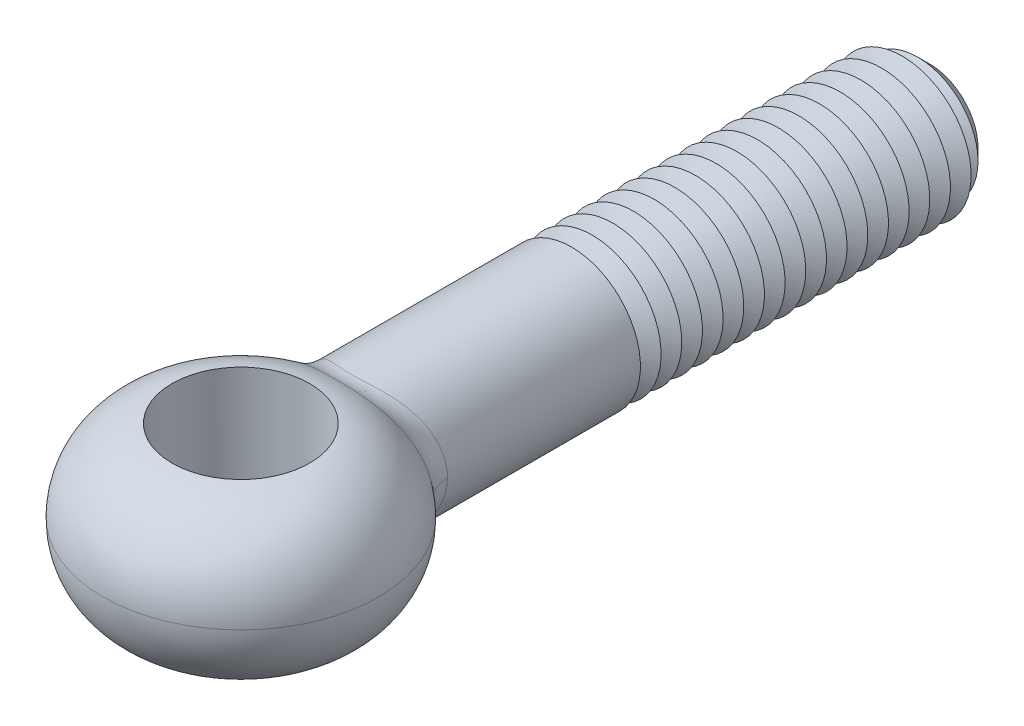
ISO-10303-21;
HEADER;
FILE_DESCRIPTION(('STEP AP214'),'2;1');
FILE_NAME('part.step','',(''),(''),'','','');
FILE_SCHEMA(('AUTOMOTIVE_DESIGN { 1 0 10303 214 1 1 1 1 }'));
ENDSEC;
DATA;
#1=APPLICATION_CONTEXT('core data for automotive mechanical design processes');
#2=APPLICATION_PROTOCOL_DEFINITION('international standard','automotive_design',2000,#1);
#3=PRODUCT_CONTEXT('',#1,'mechanical');
#4=PRODUCT('Part','Part','',(#3));
#5=PRODUCT_RELATED_PRODUCT_CATEGORY('part','',(#4));
#6=PRODUCT_DEFINITION_FORMATION('','',#4);
#7=PRODUCT_DEFINITION_CONTEXT('part definition',#1,'design');
#8=PRODUCT_DEFINITION('design','',#6,#7);
#9=PRODUCT_DEFINITION_SHAPE('','',#8);
#10=(LENGTH_UNIT() NAMED_UNIT(*) SI_UNIT(.MILLI.,.METRE.));
#11=(NAMED_UNIT(*) PLANE_ANGLE_UNIT() SI_UNIT($,.RADIAN.));
#12=(NAMED_UNIT(*) SI_UNIT($,.STERADIAN.) SOLID_ANGLE_UNIT());
#13=UNCERTAINTY_MEASURE_WITH_UNIT(LENGTH_MEASURE(1.E-05),#10,'distance_accuracy_value','');
#14=(GEOMETRIC_REPRESENTATION_CONTEXT(3) GLOBAL_UNCERTAINTY_ASSIGNED_CONTEXT((#13)) GLOBAL_UNIT_ASSIGNED_CONTEXT((#10,
#11,#12)) REPRESENTATION_CONTEXT('',''));
#15=CARTESIAN_POINT('',(0.,0.,0.));
#16=DIRECTION('',(0.,0.,1.));
#17=DIRECTION('',(1.,0.,0.));
#18=AXIS2_PLACEMENT_3D('',#15,#16,#17);
#19=CARTESIAN_POINT('',(0.,0.,-50.));
#20=DIRECTION('',(0.,0.,1.));
#21=DIRECTION('',(1.,0.,0.));
#22=AXIS2_PLACEMENT_3D('',#19,#20,#21);
#23=CYLINDRICAL_SURFACE('',#22,5.);
#24=CARTESIAN_POINT('',(0.,0.,-24.));
#25=DIRECTION('',(0.,0.,-1.));
#26=DIRECTION('',(-1.,0.,0.));
#27=AXIS2_PLACEMENT_3D('',#24,#25,#26);
#28=CIRCLE('',#27,5.);
#29=CARTESIAN_POINT('',(-5.,0.,-24.));
#30=VERTEX_POINT('',#29);
#31=EDGE_CURVE('E79',#30,#30,#28,.T.);
#32=ORIENTED_EDGE('',*,*,#31,.F.);
#33=EDGE_LOOP('',(#32));
#34=FACE_BOUND('',#33,.T.);
#35=CARTESIAN_POINT('',(5.70933633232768,-1.67793970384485,-7.91661551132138));
#36=CARTESIAN_POINT('',(4.78485907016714,-1.45712787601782,-8.66263274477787));
#37=CARTESIAN_POINT('',(4.74222098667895,-1.58472083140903,-9.86340741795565));
#38=CARTESIAN_POINT('',(5.75730171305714,-1.54348560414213,-7.93032827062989));
#39=CARTESIAN_POINT('',(4.82077417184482,-1.33824625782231,-8.67714724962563));
#40=CARTESIAN_POINT('',(4.78467318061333,-1.45773640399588,-9.88591758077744));
#41=CARTESIAN_POINT('',(5.79949566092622,-1.40701265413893,-7.94241329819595));
#42=CARTESIAN_POINT('',(4.85215615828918,-1.2184928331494,-8.68986188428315));
#43=CARTESIAN_POINT('',(4.82205710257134,-1.3288452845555,-9.90573407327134));
#44=CARTESIAN_POINT('',(5.87207824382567,-1.13100094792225,-7.96322651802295));
#45=CARTESIAN_POINT('',(4.90596898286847,-0.977373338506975,-8.71170047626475));
#46=CARTESIAN_POINT('',(4.8864097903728,-1.06816756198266,-9.93983844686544));
#47=CARTESIAN_POINT('',(5.90246657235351,-0.991462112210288,-7.97195462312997));
#48=CARTESIAN_POINT('',(4.92837078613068,-0.856067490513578,-8.72081272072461));
#49=CARTESIAN_POINT('',(4.91337828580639,-0.936380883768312,-9.95412618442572));
#50=CARTESIAN_POINT('',(5.95114734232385,-0.710445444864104,-7.9859445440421));
#51=CARTESIAN_POINT('',(4.96420368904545,-0.612503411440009,-8.73540084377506));
#52=CARTESIAN_POINT('',(4.95659653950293,-0.670976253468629,-9.9770185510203));
#53=CARTESIAN_POINT('',(5.96945246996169,-0.568969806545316,-7.99120999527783));
#54=CARTESIAN_POINT('',(4.97762446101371,-0.4903115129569,-8.7408725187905));
#55=CARTESIAN_POINT('',(4.97285753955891,-0.53736037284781,-9.98562914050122));
#56=CARTESIAN_POINT('',(5.99388312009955,-0.285021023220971,-7.99823914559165));
#57=CARTESIAN_POINT('',(4.99552781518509,-0.245401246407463,-8.74817451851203));
#58=CARTESIAN_POINT('',(4.9945634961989,-0.269186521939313,-9.99712197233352));
#59=CARTESIAN_POINT('',(6.00000915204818,-0.142547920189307,-8.00000299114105));
#60=CARTESIAN_POINT('',(5.00000073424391,-0.122751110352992,-8.75000090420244));
#61=CARTESIAN_POINT('',(5.00000890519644,-0.134628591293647,-10.0000044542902));
#62=CARTESIAN_POINT('',(5.99998170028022,0.285027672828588,-7.9999940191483));
#63=CARTESIAN_POINT('',(4.99999853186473,0.245443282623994,-8.74999819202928));
#64=CARTESIAN_POINT('',(4.99998219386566,0.269192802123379,-9.99999109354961));
#65=CARTESIAN_POINT('',(5.97543439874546,0.570354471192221,-7.99292407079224));
#66=CARTESIAN_POINT('',(4.9821186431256,0.490872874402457,-8.74269384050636));
#67=CARTESIAN_POINT('',(4.97815756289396,0.538668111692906,-9.98843996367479));
#68=CARTESIAN_POINT('',(5.87802487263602,1.13244543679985,-7.96493065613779));
#69=CARTESIAN_POINT('',(4.9104019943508,0.97806395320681,-8.71349780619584));
#70=CARTESIAN_POINT('',(4.89167997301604,1.06953180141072,-9.94263205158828));
#71=CARTESIAN_POINT('',(5.80517393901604,1.40921158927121,-7.94401042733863));
#72=CARTESIAN_POINT('',(4.85673202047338,1.2193014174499,-8.69167389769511));
#73=CARTESIAN_POINT('',(4.82703702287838,1.33092205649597,-9.90838057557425));
#74=CARTESIAN_POINT('',(5.61360560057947,1.94636814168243,-7.88925114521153));
#75=CARTESIAN_POINT('',(4.71337355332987,1.6936723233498,-8.63374813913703));
#76=CARTESIAN_POINT('',(4.65749953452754,1.83823657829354,-9.81848441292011));
#77=CARTESIAN_POINT('',(5.49493943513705,2.20677645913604,-7.85542652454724));
#78=CARTESIAN_POINT('',(4.62401912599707,1.92638432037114,-8.5977797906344));
#79=CARTESIAN_POINT('',(4.55264996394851,2.08417776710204,-9.76286362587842));
#80=CARTESIAN_POINT('',(5.21512465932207,2.70477762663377,-7.77634454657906));
#81=CARTESIAN_POINT('',(4.40944274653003,2.37905924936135,-8.51226210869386));
#82=CARTESIAN_POINT('',(4.30638809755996,2.55451220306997,-9.63232210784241));
#83=CARTESIAN_POINT('',(5.05396822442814,2.94236626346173,-7.73108508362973));
#84=CARTESIAN_POINT('',(4.28460020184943,2.59873536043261,-8.46285983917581));
#85=CARTESIAN_POINT('',(4.16496906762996,2.77890147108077,-9.55739782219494));
#86=CARTESIAN_POINT('',(4.68878033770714,3.39465162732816,-7.63009758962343));
#87=CARTESIAN_POINT('',(3.99636042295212,3.02506283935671,-8.35059743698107));
#88=CARTESIAN_POINT('',(3.84629057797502,3.20605987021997,-9.38937425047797));
#89=CARTESIAN_POINT('',(4.48379609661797,3.6086457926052,-7.5741404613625));
#90=CARTESIAN_POINT('',(3.83251261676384,3.23118784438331,-8.28758835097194));
#91=CARTESIAN_POINT('',(3.66823867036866,3.40816547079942,-9.29587502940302));
#92=CARTESIAN_POINT('',(4.03738444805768,4.00257302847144,-7.45571442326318));
#93=CARTESIAN_POINT('',(3.4692141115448,3.61860897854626,-8.151626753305));
#94=CARTESIAN_POINT('',(3.28354447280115,3.78020786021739,-9.0966982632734));
#95=CARTESIAN_POINT('',(3.79593554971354,4.18248587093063,-7.39324168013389));
#96=CARTESIAN_POINT('',(3.27014962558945,3.79997642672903,-8.07879276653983));
#97=CARTESIAN_POINT('',(3.07688532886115,3.95012554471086,-8.99101354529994));
#98=CARTESIAN_POINT('',(3.40123219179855,4.42911791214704,-7.29642098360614));
#99=CARTESIAN_POINT('',(2.93930728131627,4.05417647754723,-7.96363404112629));
#100=CARTESIAN_POINT('',(2.74263758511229,4.18305580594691,-8.82596610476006));
#101=CARTESIAN_POINT('',(3.25969837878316,4.50936136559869,-7.26261845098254));
#102=CARTESIAN_POINT('',(2.8201432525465,4.13782103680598,-7.92314276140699));
#103=CARTESIAN_POINT('',(2.62340068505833,4.25884128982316,-8.76811514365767));
#104=CARTESIAN_POINT('',(2.96753926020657,4.65896012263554,-7.19555640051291));
#105=CARTESIAN_POINT('',(2.57266117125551,4.2954808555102,-7.84210488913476));
#106=CARTESIAN_POINT('',(2.37882216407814,4.40012900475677,-8.65285466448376));
#107=CARTESIAN_POINT('',(2.81691254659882,4.728313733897,-7.16229696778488));
#108=CARTESIAN_POINT('',(2.44436296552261,4.36954883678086,-7.80155235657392));
#109=CARTESIAN_POINT('',(2.25347959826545,4.46562963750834,-8.59544521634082));
#110=CARTESIAN_POINT('',(2.5068398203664,4.85571433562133,-7.09757737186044));
#111=CARTESIAN_POINT('',(2.1789642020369,4.50703843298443,-7.72199796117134));
#112=CARTESIAN_POINT('',(1.99726881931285,4.58595242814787,-8.48324311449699));
#113=CARTESIAN_POINT('',(2.34739348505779,4.91376091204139,-7.06611727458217));
#114=CARTESIAN_POINT('',(2.04185963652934,4.57052436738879,-7.68297774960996));
#115=CARTESIAN_POINT('',(1.86640040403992,4.64077419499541,-8.42845055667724));
#116=CARTESIAN_POINT('',(2.01991855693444,5.01813022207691,-7.00658441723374));
#117=CARTESIAN_POINT('',(1.7592739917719,4.68575118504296,-7.60861634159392));
#118=CARTESIAN_POINT('',(1.59962901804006,4.73934521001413,-8.32432471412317));
#119=CARTESIAN_POINT('',(1.85189250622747,5.0644564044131,-6.97851066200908));
#120=CARTESIAN_POINT('',(1.61375899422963,4.73756667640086,-7.57324263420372));
#121=CARTESIAN_POINT('',(1.46372754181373,4.78309771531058,-8.27498982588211));
#122=CARTESIAN_POINT('',(1.54958918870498,5.13512197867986,-6.93385736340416));
#123=CARTESIAN_POINT('',(1.35128568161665,4.81724563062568,-7.51664891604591));
#124=CARTESIAN_POINT('',(1.22100149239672,4.84983742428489,-8.19622805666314));
#125=CARTESIAN_POINT('',(1.41702320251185,5.16206874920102,-6.91614202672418));
#126=CARTESIAN_POINT('',(1.23600744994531,4.84788364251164,-7.49407261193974));
#127=CARTESIAN_POINT('',(1.11512872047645,4.87528715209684,-8.16487589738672));
#128=CARTESIAN_POINT('',(1.1478154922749,5.20870116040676,-6.88469379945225));
#129=CARTESIAN_POINT('',(1.00167278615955,4.9011561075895,-7.4538678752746));
#130=CARTESIAN_POINT('',(0.901179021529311,4.91932887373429,-8.10909028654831));
#131=CARTESIAN_POINT('',(1.01117500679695,5.22838898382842,-6.87095971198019));
#132=CARTESIAN_POINT('',(0.882566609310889,4.92382141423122,-7.43621856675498));
#133=CARTESIAN_POINT('',(0.793102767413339,4.93792292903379,-8.08465475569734));
#134=CARTESIAN_POINT('',(0.735138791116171,5.26020100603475,-6.84839392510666));
#135=CARTESIAN_POINT('',(0.641846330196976,4.96055155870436,-7.40716717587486));
#136=CARTESIAN_POINT('',(0.575594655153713,4.96796761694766,-8.04444298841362));
#137=CARTESIAN_POINT('',(0.595753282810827,5.27234921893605,-6.83954667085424));
#138=CARTESIAN_POINT('',(0.520175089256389,4.97466593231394,-7.39572843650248));
#139=CARTESIAN_POINT('',(0.46616824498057,4.97944092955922,-8.02863927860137));
#140=CARTESIAN_POINT('',(0.315165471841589,5.28897400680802,-6.82736189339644));
#141=CARTESIAN_POINT('',(0.275245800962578,4.99399490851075,-7.37997063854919));
#142=CARTESIAN_POINT('',(0.246357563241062,4.99514211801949,-8.00686062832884));
#143=CARTESIAN_POINT('',(0.173963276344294,5.2934510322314,-6.82402404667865));
#144=CARTESIAN_POINT('',(0.151908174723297,4.99922289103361,-7.37564077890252));
#145=CARTESIAN_POINT('',(0.135973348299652,4.99937041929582,-8.0008851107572));
#146=CARTESIAN_POINT('',(-0.108989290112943,5.29464772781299,-6.82313610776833));
#147=CARTESIAN_POINT('',(-0.0951661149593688,5.00061790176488,-7.37449052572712));
#148=CARTESIAN_POINT('',(-0.0851888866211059,5.00050063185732,-7.99929621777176));
#149=CARTESIAN_POINT('',(-0.250740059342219,5.29134475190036,-6.82560291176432));
#150=CARTESIAN_POINT('',(-0.218988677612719,4.99675944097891,-7.37769125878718));
#151=CARTESIAN_POINT('',(-0.195967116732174,4.99738115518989,-8.00371309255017));
#152=CARTESIAN_POINT('',(-0.532654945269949,5.27700059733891,-6.83615005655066));
#153=CARTESIAN_POINT('',(-0.465097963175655,4.98007057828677,-7.39133726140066));
#154=CARTESIAN_POINT('',(-0.416687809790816,4.98383389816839,-8.02257034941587));
#155=CARTESIAN_POINT('',(-0.67281897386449,5.26595899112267,-6.84423070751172));
#156=CARTESIAN_POINT('',(-0.587466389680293,4.96722840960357,-7.40179208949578));
#157=CARTESIAN_POINT('',(-0.526630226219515,4.97340571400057,-8.03701128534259));
#158=CARTESIAN_POINT('',(-0.950555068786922,5.23628582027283,-6.86540697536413));
#159=CARTESIAN_POINT('',(-0.829715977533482,4.93292383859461,-7.42907738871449));
#160=CARTESIAN_POINT('',(-0.745246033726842,4.94538105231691,-8.07476785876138));
#161=CARTESIAN_POINT('',(-1.08811773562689,5.21763079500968,-6.87851808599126));
#162=CARTESIAN_POINT('',(-0.949657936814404,4.91141341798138,-7.44594394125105));
#163=CARTESIAN_POINT('',(-0.853914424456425,4.92776241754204,-8.09811091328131));
#164=CARTESIAN_POINT('',(-1.35925236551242,5.17298457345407,-6.90887821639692));
#165=CARTESIAN_POINT('',(-1.18574740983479,4.86032128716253,-7.48480231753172));
#166=CARTESIAN_POINT('',(-1.06910038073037,4.88559654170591,-8.15200622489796));
#167=CARTESIAN_POINT('',(-1.49282310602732,5.14699115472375,-6.92612848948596));
#168=CARTESIAN_POINT('',(-1.3019475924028,4.83070907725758,-7.50681516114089));
#169=CARTESIAN_POINT('',(-1.17561728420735,4.86104720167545,-8.18256066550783));
#170=CARTESIAN_POINT('',(-1.79412725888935,5.07920893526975,-6.96939072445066));
#171=CARTESIAN_POINT('',(-1.56367143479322,4.75412691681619,-7.56172008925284));
#172=CARTESIAN_POINT('',(-1.41717349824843,4.79703066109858,-8.25893420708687));
#173=CARTESIAN_POINT('',(-1.96031219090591,5.03502254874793,-6.9964861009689));
#174=CARTESIAN_POINT('',(-1.7076868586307,4.70458666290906,-7.59591788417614));
#175=CARTESIAN_POINT('',(-1.55135538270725,4.75529907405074,-8.30659722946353));
#176=CARTESIAN_POINT('',(-2.28442640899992,4.93526422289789,-7.05416576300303));
#177=CARTESIAN_POINT('',(-1.98760872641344,4.59415189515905,-7.66809997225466));
#178=CARTESIAN_POINT('',(-1.81491123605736,4.66108287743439,-8.4075911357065));
#179=CARTESIAN_POINT('',(-2.44235350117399,4.87968927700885,-7.08475096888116));
#180=CARTESIAN_POINT('',(-2.12355225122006,4.53318622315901,-7.7061166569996));
#181=CARTESIAN_POINT('',(-1.94428392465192,4.6085954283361,-8.46092351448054));
#182=CARTESIAN_POINT('',(-2.74972999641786,4.75754570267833,-7.14786353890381));
#183=CARTESIAN_POINT('',(-2.38698376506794,4.4009346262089,-7.78387796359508));
#184=CARTESIAN_POINT('',(-2.19777297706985,4.49323760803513,-8.57047607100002));
#185=CARTESIAN_POINT('',(-2.89917785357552,4.69097507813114,-7.18039125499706));
#186=CARTESIAN_POINT('',(-2.51447749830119,4.3295842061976,-7.82364214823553));
#187=CARTESIAN_POINT('',(-2.32188838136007,4.43036535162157,-8.62669677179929));
#188=CARTESIAN_POINT('',(-3.18935059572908,4.54721522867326,-7.24614756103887));
#189=CARTESIAN_POINT('',(-2.76071126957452,4.17750789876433,-7.90331839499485));
#190=CARTESIAN_POINT('',(-2.56432860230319,4.29459216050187,-8.73986385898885));
#191=CARTESIAN_POINT('',(-3.33007632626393,4.470027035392,-7.27937608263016));
#192=CARTESIAN_POINT('',(-2.87943530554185,4.09672952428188,-7.94323785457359));
#193=CARTESIAN_POINT('',(-2.68265398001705,4.22169220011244,-8.79681017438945));
#194=CARTESIAN_POINT('',(-3.6042467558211,4.30435953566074,-7.34597396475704));
#195=CARTESIAN_POINT('',(-3.10933500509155,3.92558371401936,-8.02254739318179));
#196=CARTESIAN_POINT('',(-2.91439424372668,4.06522845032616,-8.91049638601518));
#197=CARTESIAN_POINT('',(-3.73757981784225,4.21575233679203,-7.37933998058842));
#198=CARTESIAN_POINT('',(-3.2203567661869,3.83507165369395,-8.06191973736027));
#199=CARTESIAN_POINT('',(-3.02773025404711,3.98154387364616,-8.96722500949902));
#200=CARTESIAN_POINT('',(-3.99465713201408,4.02844559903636,-7.44499615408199));
#201=CARTESIAN_POINT('',(-3.4329684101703,3.6461579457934,-8.13872764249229));
#202=CARTESIAN_POINT('',(-3.24724328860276,3.80464306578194,-9.07845523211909));
#203=CARTESIAN_POINT('',(-4.11839810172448,3.92974263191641,-7.47728594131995));
#204=CARTESIAN_POINT('',(-3.53450475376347,3.54772458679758,-8.17615102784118));
#205=CARTESIAN_POINT('',(-3.35341786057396,3.7114235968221,-9.13295606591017));
#206=CARTESIAN_POINT('',(-4.4742983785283,3.61934152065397,-7.57148302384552));
#207=CARTESIAN_POINT('',(-3.82504690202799,3.24133753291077,-8.28463882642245));
#208=CARTESIAN_POINT('',(-3.65994988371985,3.41826699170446,-9.29144497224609));
#209=CARTESIAN_POINT('',(-4.69150601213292,3.39312616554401,-7.63081129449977));
#210=CARTESIAN_POINT('',(-3.99866350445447,3.02332690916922,-8.35144779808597));
#211=CARTESIAN_POINT('',(-3.84863084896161,3.20461915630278,-9.39057819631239));
#212=CARTESIAN_POINT('',(-5.08239605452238,2.90516999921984,-7.7389888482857));
#213=CARTESIAN_POINT('',(-4.30703736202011,2.56373758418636,-8.47164826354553));
#214=CARTESIAN_POINT('',(-4.18981749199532,2.7437716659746,-9.57053028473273));
#215=CARTESIAN_POINT('',(-5.25565953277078,2.6431214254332,-7.78773667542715));
#216=CARTESIAN_POINT('',(-4.44086470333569,2.32212555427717,-8.52470741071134));
#217=CARTESIAN_POINT('',(-4.34197429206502,2.49628134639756,-9.6511722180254));
#218=CARTESIAN_POINT('',(-5.47691244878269,2.23061013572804,-7.85038077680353));
#219=CARTESIAN_POINT('',(-4.60972026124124,1.94915142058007,-8.5921412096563));
#220=CARTESIAN_POINT('',(-4.53685371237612,2.10668735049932,-9.75449897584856));
#221=CARTESIAN_POINT('',(-5.54423274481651,2.08983618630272,-7.86951868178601));
#222=CARTESIAN_POINT('',(-4.66073830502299,1.82281743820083,-8.61261317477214));
#223=CARTESIAN_POINT('',(-4.59626286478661,1.97373417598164,-9.78600646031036));
#224=CARTESIAN_POINT('',(-5.6655118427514,1.80280855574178,-7.90408060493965));
#225=CARTESIAN_POINT('',(-4.75217227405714,1.56712957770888,-8.64941478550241));
#226=CARTESIAN_POINT('',(-4.70342427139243,1.70265252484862,-9.84283573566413));
#227=CARTESIAN_POINT('',(-5.71947280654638,1.65655576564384,-7.91950522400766));
#228=CARTESIAN_POINT('',(-4.79253620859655,1.43783844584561,-8.66572382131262));
#229=CARTESIAN_POINT('',(-4.75117841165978,1.56452488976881,-9.86815852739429));
#230=CARTESIAN_POINT('',(-5.84364491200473,1.26465047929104,-7.95505164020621));
#231=CARTESIAN_POINT('',(-4.88513469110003,1.09319520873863,-8.7032138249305));
#232=CARTESIAN_POINT('',(-4.86116183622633,1.19439211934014,-9.92646411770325));
#233=CARTESIAN_POINT('',(-5.90216979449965,1.0152606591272,-7.97186627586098));
#234=CARTESIAN_POINT('',(-4.9281911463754,0.87634254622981,-8.72073502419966));
#235=CARTESIAN_POINT('',(-4.91310928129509,0.958857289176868,-9.95398462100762));
#236=CARTESIAN_POINT('',(-5.98033817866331,0.510520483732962,-7.99433762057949));
#237=CARTESIAN_POINT('',(-4.98567189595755,0.439420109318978,-8.74414731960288));
#238=CARTESIAN_POINT('',(-4.98251976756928,0.482158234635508,-9.99074818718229));
#239=CARTESIAN_POINT('',(-5.99999017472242,0.255171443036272,-7.99999676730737));
#240=CARTESIAN_POINT('',(-5.00000016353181,0.219732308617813,-8.74999935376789));
#241=CARTESIAN_POINT('',(-4.99999034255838,0.240995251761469,-9.99999524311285));
#242=CARTESIAN_POINT('',(-6.00000548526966,-0.142457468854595,-8.00000180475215));
#243=CARTESIAN_POINT('',(-4.99999990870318,-0.12267252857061,-8.75000036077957));
#244=CARTESIAN_POINT('',(-5.00000539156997,-0.134543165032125,-10.0000026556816));
#245=CARTESIAN_POINT('',(-5.99388893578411,-0.284859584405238,-7.99824078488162));
#246=CARTESIAN_POINT('',(-4.99553255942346,-0.245262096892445,-8.74817640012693));
#247=CARTESIAN_POINT('',(-4.9945685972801,-0.269034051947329,-9.99712468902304));
#248=CARTESIAN_POINT('',(-5.96948629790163,-0.568670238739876,-7.99121976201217));
#249=CARTESIAN_POINT('',(-4.97764876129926,-0.490053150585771,-8.74088248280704));
#250=CARTESIAN_POINT('',(-4.97288766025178,-0.537077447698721,-9.98564507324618));
#251=CARTESIAN_POINT('',(-5.95119862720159,-0.71007864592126,-7.98595930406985));
#252=CARTESIAN_POINT('',(-4.96424116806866,-0.612186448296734,-8.73541613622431));
#253=CARTESIAN_POINT('',(-4.9566421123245,-0.670629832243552,-9.97704267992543));
#254=CARTESIAN_POINT('',(-5.90253985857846,-0.991109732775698,-7.9719756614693));
#255=CARTESIAN_POINT('',(-4.92842498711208,-0.855761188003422,-8.72083475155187));
#256=CARTESIAN_POINT('',(-4.9134433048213,-0.936048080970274,-9.95416063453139));
#257=CARTESIAN_POINT('',(-5.87214378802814,-1.13072810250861,-7.96324532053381));
#258=CARTESIAN_POINT('',(-4.90601756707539,-0.977135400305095,-8.71172020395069));
#259=CARTESIAN_POINT('',(-4.88646791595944,-1.06790987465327,-9.93986924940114));
#260=CARTESIAN_POINT('',(-5.79953551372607,-1.40688471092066,-7.94242472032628));
#261=CARTESIAN_POINT('',(-4.85218573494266,-1.21838046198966,-8.68987387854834));
#262=CARTESIAN_POINT('',(-4.82209242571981,-1.32872444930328,-9.90575279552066));
#263=CARTESIAN_POINT('',(-5.75732457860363,-1.54342327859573,-7.9303348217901));
#264=CARTESIAN_POINT('',(-4.82079113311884,-1.33819110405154,-8.67715412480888));
#265=CARTESIAN_POINT('',(-4.78469344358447,-1.45767754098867,-9.8859283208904));
#266=CARTESIAN_POINT('',(-5.70933633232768,-1.67793970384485,-7.91661551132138));
#267=CARTESIAN_POINT('',(-4.78485907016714,-1.45712787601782,-8.66263274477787));
#268=CARTESIAN_POINT('',(-4.74222098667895,-1.58472083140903,-9.86340741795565));
#269=(BOUNDED_SURFACE() B_SPLINE_SURFACE(3,2,((#35,#36,#37),(#38,#39,#40),(#41,#42,#43),(#44,
#45,#46),(#47,#48,#49),(#50,#51,#52),(#53,#54,#55),(#56,#57,#58),(#59,#60,#61),(#62,#63,#64),
(#65,#66,#67),(#68,#69,#70),(#71,#72,#73),(#74,#75,#76),(#77,#78,#79),(#80,#81,#82),(#83,#84,
#85),(#86,#87,#88),(#89,#90,#91),(#92,#93,#94),(#95,#96,#97),(#98,#99,#100),(#101,#102,#103),
(#104,#105,#106),(#107,#108,#109),(#110,#111,#112),(#113,#114,#115),(#116,#117,#118),(#119,#120,
#121),(#122,#123,#124),(#125,#126,#127),(#128,#129,#130),(#131,#132,#133),(#134,#135,#136),
(#137,#138,#139),(#140,#141,#142),(#143,#144,#145),(#146,#147,#148),(#149,#150,#151),(#152,#153,
#154),(#155,#156,#157),(#158,#159,#160),(#161,#162,#163),(#164,#165,#166),(#167,#168,#169),
(#170,#171,#172),(#173,#174,#175),(#176,#177,#178),(#179,#180,#181),(#182,#183,#184),(#185,#186,
#187),(#188,#189,#190),(#191,#192,#193),(#194,#195,#196),(#197,#198,#199),(#200,#201,#202),
(#203,#204,#205),(#206,#207,#208),(#209,#210,#211),(#212,#213,#214),(#215,#216,#217),(#218,#219,
#220),(#221,#222,#223),(#224,#225,#226),(#227,#228,#229),(#230,#231,#232),(#233,#234,#235),
(#236,#237,#238),(#239,#240,#241),(#242,#243,#244),(#245,#246,#247),(#248,#249,#250),(#251,#252,
#253),(#254,#255,#256),(#257,#258,#259),(#260,#261,#262),(#263,#264,#265),(#266,#267,#268)),
.UNSPECIFIED.,.F.,.F.,.F.) B_SPLINE_SURFACE_WITH_KNOTS((4,2,2,2,2,2,2,2,2,2,2,2,2,2,2,2,2,2,2,2,
2,2,2,2,2,2,2,2,2,2,2,2,2,2,2,2,2,2,4),(3,3),(0.,0.606107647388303,1.21223102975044,
1.81771702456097,2.42317769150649,3.63380948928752,4.8441584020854,6.05315757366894,
7.26237953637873,8.50119582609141,9.74074509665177,10.3991744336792,11.0577059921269,
11.7162616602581,12.3746233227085,12.8731342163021,13.3714950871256,13.8682603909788,
14.3649965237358,14.8631803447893,15.3613916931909,15.8611500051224,16.3610598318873,
17.0084707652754,17.6560528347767,18.3037525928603,18.9513894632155,19.607039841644,
20.2629136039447,21.5729073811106,22.8949562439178,23.5562483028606,24.2174332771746,
25.3015758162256,26.385481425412,26.9906057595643,27.5958087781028,28.2022664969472,
28.8086591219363),(0.,1.),
.UNSPECIFIED.) GEOMETRIC_REPRESENTATION_ITEM() RATIONAL_B_SPLINE_SURFACE(((1.,0.90035547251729,
1.),(1.,0.899388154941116,1.),(1.,0.898532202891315,1.),(1.,0.897054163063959,1.),(1.,
0.896432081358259,1.),(1.,0.895433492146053,1.),(1.,0.895056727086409,1.),(1.,0.894553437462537,
1.),(1.,0.894426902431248,1.),(1.,0.894427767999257,1.),(1.,0.89493539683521,1.),(1.,
0.896933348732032,1.),(1.,0.898423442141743,1.),(1.,0.902285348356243,1.),(1.,0.904656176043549,
1.),(1.,0.910127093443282,1.),(1.,0.913227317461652,1.),(1.,0.9200380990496,1.),(1.,
0.923761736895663,1.),(1.,0.931504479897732,1.),(1.,0.935523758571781,1.),(1.,0.941644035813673,
1.),(1.,0.943760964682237,1.),(1.,0.947923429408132,1.),(1.,0.949968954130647,1.),(1.,
0.953916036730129,1.),(1.,0.955817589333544,1.),(1.,0.959389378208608,1.),(1.,0.96105968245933,
1.),(1.,0.963700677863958,1.),(1.,0.964742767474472,1.),(1.,0.966586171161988,1.),(1.,
0.967387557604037,1.),(1.,0.968701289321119,1.),(1.,0.969214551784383,1.),(1.,0.96992083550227,
1.),(1.,0.970113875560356,1.),(1.,0.97016526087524,1.),(1.,0.970022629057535,1.),(1.,
0.96941153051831,1.),(1.,0.968943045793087,1.),(1.,0.967711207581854,1.),(1.,0.966946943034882,
1.),(1.,0.965169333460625,1.),(1.,0.964155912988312,1.),(1.,0.961600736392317,1.),(1.,
0.959991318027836,1.),(1.,0.956537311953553,1.),(1.,0.954692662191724,1.),(1.,0.950852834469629,
1.),(1.,0.948857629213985,1.),(1.,0.944787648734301,1.),(1.,0.942712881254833,1.),(1.,
0.938516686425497,1.),(1.,0.936394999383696,1.),(1.,0.932182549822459,1.),(1.,0.930091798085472,
1.),(1.,0.923939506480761,1.),(1.,0.91999203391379,1.),(1.,0.912692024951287,1.),(1.,
0.909345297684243,1.),(1.,0.905000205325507,1.),(1.,0.903664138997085,1.),(1.,0.901240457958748,
1.),(1.,0.900152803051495,1.),(1.,0.897638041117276,1.),(1.,0.896438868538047,1.),(1.,
0.894833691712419,1.),(1.,0.894427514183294,1.),(1.,0.894427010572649,1.),(1.,0.894553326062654,
1.),(1.,0.895056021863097,1.),(1.,0.895432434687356,1.),(1.,0.896430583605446,1.),(1.,
0.897052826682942,1.),(1.,0.898531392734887,1.),(1.,0.89938769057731,1.),(1.,0.90035547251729,1.))) REPRESENTATION_ITEM('') SURFACE());
#270=CARTESIAN_POINT('',(-4.74222098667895,-1.58472083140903,-9.86340741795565));
#271=CARTESIAN_POINT('',(-4.78469344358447,-1.45767754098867,-9.8859283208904));
#272=CARTESIAN_POINT('',(-4.82209242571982,-1.32872444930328,-9.90575279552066));
#273=CARTESIAN_POINT('',(-4.88646791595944,-1.06790987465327,-9.93986924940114));
#274=CARTESIAN_POINT('',(-4.9134433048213,-0.936048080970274,-9.95416063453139));
#275=CARTESIAN_POINT('',(-4.9566421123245,-0.670629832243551,-9.97704267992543));
#276=CARTESIAN_POINT('',(-4.97288766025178,-0.537077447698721,-9.98564507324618));
#277=CARTESIAN_POINT('',(-4.9945685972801,-0.269034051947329,-9.99712468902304));
#278=CARTESIAN_POINT('',(-5.00000539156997,-0.134543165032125,-10.0000026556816));
#279=CARTESIAN_POINT('',(-4.99999034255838,0.240995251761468,-9.99999524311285));
#280=CARTESIAN_POINT('',(-4.98251976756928,0.482158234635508,-9.99074818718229));
#281=CARTESIAN_POINT('',(-4.91310928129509,0.958857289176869,-9.95398462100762));
#282=CARTESIAN_POINT('',(-4.86116183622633,1.19439211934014,-9.92646411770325));
#283=CARTESIAN_POINT('',(-4.75117841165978,1.56452488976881,-9.86815852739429));
#284=CARTESIAN_POINT('',(-4.70342427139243,1.70265252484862,-9.84283573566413));
#285=CARTESIAN_POINT('',(-4.59626286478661,1.97373417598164,-9.78600646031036));
#286=CARTESIAN_POINT('',(-4.53685371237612,2.10668735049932,-9.75449897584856));
#287=CARTESIAN_POINT('',(-4.34197429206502,2.49628134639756,-9.6511722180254));
#288=CARTESIAN_POINT('',(-4.18981749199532,2.7437716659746,-9.57053028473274));
#289=CARTESIAN_POINT('',(-3.84863084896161,3.20461915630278,-9.39057819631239));
#290=CARTESIAN_POINT('',(-3.65994988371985,3.41826699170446,-9.29144497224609));
#291=CARTESIAN_POINT('',(-3.35341786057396,3.7114235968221,-9.13295606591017));
#292=CARTESIAN_POINT('',(-3.24724328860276,3.80464306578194,-9.07845523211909));
#293=CARTESIAN_POINT('',(-3.02773025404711,3.98154387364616,-8.96722500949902));
#294=CARTESIAN_POINT('',(-2.91439424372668,4.06522845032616,-8.91049638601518));
#295=CARTESIAN_POINT('',(-2.68265398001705,4.22169220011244,-8.79681017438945));
#296=CARTESIAN_POINT('',(-2.56432860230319,4.29459216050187,-8.73986385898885));
#297=CARTESIAN_POINT('',(-2.32188838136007,4.43036535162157,-8.62669677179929));
#298=CARTESIAN_POINT('',(-2.19777297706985,4.49323760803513,-8.57047607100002));
#299=CARTESIAN_POINT('',(-1.94428392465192,4.6085954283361,-8.46092351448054));
#300=CARTESIAN_POINT('',(-1.81491123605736,4.66108287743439,-8.4075911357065));
#301=CARTESIAN_POINT('',(-1.55135538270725,4.75529907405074,-8.30659722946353));
#302=CARTESIAN_POINT('',(-1.41717349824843,4.79703066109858,-8.25893420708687));
#303=CARTESIAN_POINT('',(-1.17561728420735,4.86104720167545,-8.18256066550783));
#304=CARTESIAN_POINT('',(-1.06910038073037,4.88559654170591,-8.15200622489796));
#305=CARTESIAN_POINT('',(-0.853914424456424,4.92776241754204,-8.09811091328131));
#306=CARTESIAN_POINT('',(-0.745246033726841,4.94538105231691,-8.07476785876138));
#307=CARTESIAN_POINT('',(-0.526630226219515,4.97340571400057,-8.03701128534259));
#308=CARTESIAN_POINT('',(-0.416687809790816,4.98383389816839,-8.02257034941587));
#309=CARTESIAN_POINT('',(-0.195967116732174,4.99738115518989,-8.00371309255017));
#310=CARTESIAN_POINT('',(-0.0851888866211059,5.00050063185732,-7.99929621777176));
#311=CARTESIAN_POINT('',(0.135973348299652,4.99937041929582,-8.0008851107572));
#312=CARTESIAN_POINT('',(0.246357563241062,4.99514211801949,-8.00686062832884));
#313=CARTESIAN_POINT('',(0.46616824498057,4.97944092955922,-8.02863927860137));
#314=CARTESIAN_POINT('',(0.575594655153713,4.96796761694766,-8.04444298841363));
#315=CARTESIAN_POINT('',(0.793102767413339,4.93792292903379,-8.08465475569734));
#316=CARTESIAN_POINT('',(0.901179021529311,4.91932887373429,-8.10909028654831));
#317=CARTESIAN_POINT('',(1.11512872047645,4.87528715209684,-8.16487589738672));
#318=CARTESIAN_POINT('',(1.22100149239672,4.84983742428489,-8.19622805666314));
#319=CARTESIAN_POINT('',(1.46372754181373,4.78309771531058,-8.27498982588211));
#320=CARTESIAN_POINT('',(1.59962901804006,4.73934521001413,-8.32432471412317));
#321=CARTESIAN_POINT('',(1.86640040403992,4.64077419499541,-8.42845055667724));
#322=CARTESIAN_POINT('',(1.99726881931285,4.58595242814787,-8.48324311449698));
#323=CARTESIAN_POINT('',(2.25347959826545,4.46562963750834,-8.59544521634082));
#324=CARTESIAN_POINT('',(2.37882216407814,4.40012900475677,-8.65285466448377));
#325=CARTESIAN_POINT('',(2.62340068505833,4.25884128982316,-8.76811514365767));
#326=CARTESIAN_POINT('',(2.74263758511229,4.18305580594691,-8.82596610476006));
#327=CARTESIAN_POINT('',(3.07688532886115,3.95012554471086,-8.99101354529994));
#328=CARTESIAN_POINT('',(3.28354447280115,3.78020786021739,-9.0966982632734));
#329=CARTESIAN_POINT('',(3.66823867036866,3.40816547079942,-9.29587502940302));
#330=CARTESIAN_POINT('',(3.84629057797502,3.20605987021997,-9.38937425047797));
#331=CARTESIAN_POINT('',(4.16496906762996,2.77890147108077,-9.55739782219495));
#332=CARTESIAN_POINT('',(4.30638809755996,2.55451220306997,-9.63232210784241));
#333=CARTESIAN_POINT('',(4.55264996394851,2.08417776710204,-9.76286362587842));
#334=CARTESIAN_POINT('',(4.65749953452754,1.83823657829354,-9.81848441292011));
#335=CARTESIAN_POINT('',(4.82703702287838,1.33092205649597,-9.90838057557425));
#336=CARTESIAN_POINT('',(4.89167997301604,1.06953180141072,-9.94263205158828));
#337=CARTESIAN_POINT('',(4.97815756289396,0.538668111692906,-9.98843996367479));
#338=CARTESIAN_POINT('',(4.99998219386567,0.269192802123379,-9.99999109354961));
#339=CARTESIAN_POINT('',(5.00000890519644,-0.134628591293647,-10.0000044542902));
#340=CARTESIAN_POINT('',(4.99456349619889,-0.269186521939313,-9.99712197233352));
#341=CARTESIAN_POINT('',(4.97285753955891,-0.53736037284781,-9.98562914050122));
#342=CARTESIAN_POINT('',(4.95659653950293,-0.670976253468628,-9.9770185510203));
#343=CARTESIAN_POINT('',(4.91337828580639,-0.936380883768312,-9.95412618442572));
#344=CARTESIAN_POINT('',(4.8864097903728,-1.06816756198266,-9.93983844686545));
#345=CARTESIAN_POINT('',(4.82205710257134,-1.3288452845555,-9.90573407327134));
#346=CARTESIAN_POINT('',(4.78467318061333,-1.45773640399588,-9.88591758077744));
#347=CARTESIAN_POINT('',(4.74222098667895,-1.58472083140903,-9.86340741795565));
#348=B_SPLINE_CURVE_WITH_KNOTS('',3,(#270,#271,#272,#273,#274,#275,#276,#277,#278,#279,#280,
#281,#282,#283,#284,#285,#286,#287,#288,#289,#290,#291,#292,#293,#294,#295,#296,#297,#298,#299,
#300,#301,#302,#303,#304,#305,#306,#307,#308,#309,#310,#311,#312,#313,#314,#315,#316,#317,#318,
#319,#320,#321,#322,#323,#324,#325,#326,#327,#328,#329,#330,#331,#332,#333,#334,#335,#336,#337,
#338,#339,#340,#341,#342,#343,#344,#345,#346,#347),.UNSPECIFIED.,.F.,.F.,(4,2,2,2,2,2,2,2,2,2,2,
2,2,2,2,2,2,2,2,2,2,2,2,2,2,2,2,2,2,2,2,2,2,2,2,2,2,2,4),(0.,0.606392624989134,1.21285034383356,
1.81805336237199,2.42317769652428,3.50708330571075,4.59122584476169,5.25241081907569,
5.91370287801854,7.2357517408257,8.54574551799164,9.20161928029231,9.85726965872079,
10.504906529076,11.1526062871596,11.800188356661,12.447599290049,12.9475091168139,
13.4472674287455,13.945478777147,14.4436625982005,14.9403987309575,15.4371640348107,
15.9355249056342,16.4340357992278,17.0923974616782,17.7509531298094,18.4094846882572,
19.0679140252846,20.3074632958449,21.5462795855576,22.7555015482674,23.9645007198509,
25.1748496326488,26.3854814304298,26.9909420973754,27.5964280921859,28.202551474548,
28.8086591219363),.UNSPECIFIED.);
#349=CARTESIAN_POINT('',(-5.,0.,-10.));
#350=VERTEX_POINT('',#349);
#351=CARTESIAN_POINT('',(5.,0.,-10.));
#352=VERTEX_POINT('',#351);
#353=EDGE_CURVE('E81',#350,#352,#348,.T.);
#354=ORIENTED_EDGE('',*,*,#353,.T.);
#355=CARTESIAN_POINT('',(-5.70933633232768,1.67793970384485,-7.91661551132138));
#356=CARTESIAN_POINT('',(-4.78485907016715,1.45712787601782,-8.66263274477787));
#357=CARTESIAN_POINT('',(-4.74222098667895,1.58472083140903,-9.86340741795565));
#358=CARTESIAN_POINT('',(-5.75730171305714,1.54348560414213,-7.93032827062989));
#359=CARTESIAN_POINT('',(-4.82077417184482,1.33824625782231,-8.67714724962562));
#360=CARTESIAN_POINT('',(-4.78467318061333,1.45773640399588,-9.88591758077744));
#361=CARTESIAN_POINT('',(-5.79949566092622,1.40701265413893,-7.94241329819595));
#362=CARTESIAN_POINT('',(-4.85215615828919,1.2184928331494,-8.68986188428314));
#363=CARTESIAN_POINT('',(-4.82205710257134,1.3288452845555,-9.90573407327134));
#364=CARTESIAN_POINT('',(-5.87207824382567,1.13100094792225,-7.96322651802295));
#365=CARTESIAN_POINT('',(-4.90596898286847,0.977373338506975,-8.71170047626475));
#366=CARTESIAN_POINT('',(-4.8864097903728,1.06816756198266,-9.93983844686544));
#367=CARTESIAN_POINT('',(-5.90246657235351,0.991462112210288,-7.97195462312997));
#368=CARTESIAN_POINT('',(-4.92837078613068,0.856067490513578,-8.72081272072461));
#369=CARTESIAN_POINT('',(-4.91337828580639,0.936380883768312,-9.95412618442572));
#370=CARTESIAN_POINT('',(-5.95114734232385,0.710445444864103,-7.9859445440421));
#371=CARTESIAN_POINT('',(-4.96420368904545,0.612503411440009,-8.73540084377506));
#372=CARTESIAN_POINT('',(-4.95659653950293,0.670976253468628,-9.9770185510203));
#373=CARTESIAN_POINT('',(-5.96945246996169,0.568969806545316,-7.99120999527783));
#374=CARTESIAN_POINT('',(-4.97762446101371,0.4903115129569,-8.7408725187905));
#375=CARTESIAN_POINT('',(-4.97285753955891,0.53736037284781,-9.98562914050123));
#376=CARTESIAN_POINT('',(-5.99388312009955,0.28502102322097,-7.99823914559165));
#377=CARTESIAN_POINT('',(-4.99552781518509,0.245401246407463,-8.74817451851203));
#378=CARTESIAN_POINT('',(-4.9945634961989,0.269186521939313,-9.99712197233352));
#379=CARTESIAN_POINT('',(-6.00000915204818,0.142547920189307,-8.00000299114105));
#380=CARTESIAN_POINT('',(-5.00000073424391,0.122751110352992,-8.75000090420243));
#381=CARTESIAN_POINT('',(-5.00000890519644,0.134628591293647,-10.0000044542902));
#382=CARTESIAN_POINT('',(-5.99998170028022,-0.285027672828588,-7.9999940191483));
#383=CARTESIAN_POINT('',(-4.99999853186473,-0.245443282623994,-8.74999819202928));
#384=CARTESIAN_POINT('',(-4.99998219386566,-0.269192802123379,-9.99999109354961));
#385=CARTESIAN_POINT('',(-5.97543439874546,-0.570354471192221,-7.99292407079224));
#386=CARTESIAN_POINT('',(-4.9821186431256,-0.490872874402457,-8.74269384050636));
#387=CARTESIAN_POINT('',(-4.97815756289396,-0.538668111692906,-9.98843996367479));
#388=CARTESIAN_POINT('',(-5.87802487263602,-1.13244543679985,-7.96493065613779));
#389=CARTESIAN_POINT('',(-4.9104019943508,-0.97806395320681,-8.71349780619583));
#390=CARTESIAN_POINT('',(-4.89167997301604,-1.06953180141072,-9.94263205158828));
#391=CARTESIAN_POINT('',(-5.80517393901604,-1.40921158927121,-7.94401042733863));
#392=CARTESIAN_POINT('',(-4.85673202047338,-1.2193014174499,-8.69167389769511));
#393=CARTESIAN_POINT('',(-4.82703702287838,-1.33092205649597,-9.90838057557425));
#394=CARTESIAN_POINT('',(-5.61360560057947,-1.94636814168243,-7.88925114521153));
#395=CARTESIAN_POINT('',(-4.71337355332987,-1.6936723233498,-8.63374813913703));
#396=CARTESIAN_POINT('',(-4.65749953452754,-1.83823657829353,-9.81848441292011));
#397=CARTESIAN_POINT('',(-5.49493943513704,-2.20677645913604,-7.85542652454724));
#398=CARTESIAN_POINT('',(-4.62401912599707,-1.92638432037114,-8.5977797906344));
#399=CARTESIAN_POINT('',(-4.55264996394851,-2.08417776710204,-9.76286362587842));
#400=CARTESIAN_POINT('',(-5.21512465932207,-2.70477762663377,-7.77634454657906));
#401=CARTESIAN_POINT('',(-4.40944274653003,-2.37905924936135,-8.51226210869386));
#402=CARTESIAN_POINT('',(-4.30638809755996,-2.55451220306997,-9.63232210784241));
#403=CARTESIAN_POINT('',(-5.05396822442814,-2.94236626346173,-7.73108508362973));
#404=CARTESIAN_POINT('',(-4.28460020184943,-2.59873536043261,-8.46285983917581));
#405=CARTESIAN_POINT('',(-4.16496906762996,-2.77890147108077,-9.55739782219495));
#406=CARTESIAN_POINT('',(-4.68878033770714,-3.39465162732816,-7.63009758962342));
#407=CARTESIAN_POINT('',(-3.99636042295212,-3.02506283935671,-8.35059743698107));
#408=CARTESIAN_POINT('',(-3.84629057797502,-3.20605987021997,-9.38937425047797));
#409=CARTESIAN_POINT('',(-4.48379609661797,-3.6086457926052,-7.5741404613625));
#410=CARTESIAN_POINT('',(-3.83251261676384,-3.23118784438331,-8.28758835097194));
#411=CARTESIAN_POINT('',(-3.66823867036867,-3.40816547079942,-9.29587502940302));
#412=CARTESIAN_POINT('',(-4.03738444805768,-4.00257302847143,-7.45571442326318));
#413=CARTESIAN_POINT('',(-3.4692141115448,-3.61860897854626,-8.151626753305));
#414=CARTESIAN_POINT('',(-3.28354447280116,-3.78020786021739,-9.0966982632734));
#415=CARTESIAN_POINT('',(-3.79593554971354,-4.18248587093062,-7.3932416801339));
#416=CARTESIAN_POINT('',(-3.27014962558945,-3.79997642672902,-8.07879276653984));
#417=CARTESIAN_POINT('',(-3.07688532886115,-3.95012554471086,-8.99101354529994));
#418=CARTESIAN_POINT('',(-3.40123219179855,-4.42911791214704,-7.29642098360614));
#419=CARTESIAN_POINT('',(-2.93930728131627,-4.05417647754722,-7.96363404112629));
#420=CARTESIAN_POINT('',(-2.7426375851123,-4.18305580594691,-8.82596610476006));
#421=CARTESIAN_POINT('',(-3.25969837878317,-4.50936136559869,-7.26261845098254));
#422=CARTESIAN_POINT('',(-2.8201432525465,-4.13782103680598,-7.92314276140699));
#423=CARTESIAN_POINT('',(-2.62340068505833,-4.25884128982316,-8.76811514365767));
#424=CARTESIAN_POINT('',(-2.96753926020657,-4.65896012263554,-7.19555640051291));
#425=CARTESIAN_POINT('',(-2.57266117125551,-4.29548085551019,-7.84210488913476));
#426=CARTESIAN_POINT('',(-2.37882216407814,-4.40012900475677,-8.65285466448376));
#427=CARTESIAN_POINT('',(-2.81691254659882,-4.72831373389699,-7.16229696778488));
#428=CARTESIAN_POINT('',(-2.44436296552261,-4.36954883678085,-7.80155235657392));
#429=CARTESIAN_POINT('',(-2.25347959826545,-4.46562963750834,-8.59544521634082));
#430=CARTESIAN_POINT('',(-2.5068398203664,-4.85571433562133,-7.09757737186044));
#431=CARTESIAN_POINT('',(-2.1789642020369,-4.50703843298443,-7.72199796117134));
#432=CARTESIAN_POINT('',(-1.99726881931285,-4.58595242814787,-8.48324311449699));
#433=CARTESIAN_POINT('',(-2.34739348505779,-4.91376091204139,-7.06611727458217));
#434=CARTESIAN_POINT('',(-2.04185963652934,-4.57052436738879,-7.68297774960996));
#435=CARTESIAN_POINT('',(-1.86640040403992,-4.64077419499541,-8.42845055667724));
#436=CARTESIAN_POINT('',(-2.01991855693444,-5.01813022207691,-7.00658441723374));
#437=CARTESIAN_POINT('',(-1.7592739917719,-4.68575118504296,-7.60861634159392));
#438=CARTESIAN_POINT('',(-1.59962901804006,-4.73934521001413,-8.32432471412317));
#439=CARTESIAN_POINT('',(-1.85189250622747,-5.0644564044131,-6.97851066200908));
#440=CARTESIAN_POINT('',(-1.61375899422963,-4.73756667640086,-7.57324263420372));
#441=CARTESIAN_POINT('',(-1.46372754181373,-4.78309771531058,-8.27498982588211));
#442=CARTESIAN_POINT('',(-1.54958918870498,-5.13512197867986,-6.93385736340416));
#443=CARTESIAN_POINT('',(-1.35128568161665,-4.81724563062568,-7.51664891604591));
#444=CARTESIAN_POINT('',(-1.22100149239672,-4.84983742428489,-8.19622805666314));
#445=CARTESIAN_POINT('',(-1.41702320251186,-5.16206874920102,-6.91614202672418));
#446=CARTESIAN_POINT('',(-1.23600744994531,-4.84788364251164,-7.49407261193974));
#447=CARTESIAN_POINT('',(-1.11512872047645,-4.87528715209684,-8.16487589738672));
#448=CARTESIAN_POINT('',(-1.1478154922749,-5.20870116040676,-6.88469379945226));
#449=CARTESIAN_POINT('',(-1.00167278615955,-4.9011561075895,-7.4538678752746));
#450=CARTESIAN_POINT('',(-0.901179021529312,-4.91932887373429,-8.10909028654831));
#451=CARTESIAN_POINT('',(-1.01117500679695,-5.22838898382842,-6.87095971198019));
#452=CARTESIAN_POINT('',(-0.88256660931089,-4.92382141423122,-7.43621856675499));
#453=CARTESIAN_POINT('',(-0.79310276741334,-4.93792292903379,-8.08465475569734));
#454=CARTESIAN_POINT('',(-0.735138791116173,-5.26020100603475,-6.84839392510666));
#455=CARTESIAN_POINT('',(-0.641846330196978,-4.96055155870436,-7.40716717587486));
#456=CARTESIAN_POINT('',(-0.575594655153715,-4.96796761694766,-8.04444298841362));
#457=CARTESIAN_POINT('',(-0.59575328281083,-5.27234921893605,-6.83954667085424));
#458=CARTESIAN_POINT('',(-0.520175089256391,-4.97466593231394,-7.39572843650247));
#459=CARTESIAN_POINT('',(-0.466168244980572,-4.97944092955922,-8.02863927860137));
#460=CARTESIAN_POINT('',(-0.315165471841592,-5.28897400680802,-6.82736189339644));
#461=CARTESIAN_POINT('',(-0.27524580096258,-4.99399490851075,-7.37997063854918));
#462=CARTESIAN_POINT('',(-0.246357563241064,-4.99514211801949,-8.00686062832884));
#463=CARTESIAN_POINT('',(-0.173963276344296,-5.2934510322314,-6.82402404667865));
#464=CARTESIAN_POINT('',(-0.1519081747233,-4.9992228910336,-7.37564077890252));
#465=CARTESIAN_POINT('',(-0.135973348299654,-4.99937041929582,-8.0008851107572));
#466=CARTESIAN_POINT('',(0.108989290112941,-5.29464772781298,-6.82313610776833));
#467=CARTESIAN_POINT('',(0.0951661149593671,-5.00061790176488,-7.37449052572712));
#468=CARTESIAN_POINT('',(0.0851888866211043,-5.00050063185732,-7.99929621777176));
#469=CARTESIAN_POINT('',(0.250740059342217,-5.29134475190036,-6.82560291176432));
#470=CARTESIAN_POINT('',(0.218988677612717,-4.99675944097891,-7.37769125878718));
#471=CARTESIAN_POINT('',(0.195967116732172,-4.99738115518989,-8.00371309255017));
#472=CARTESIAN_POINT('',(0.532654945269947,-5.27700059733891,-6.83615005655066));
#473=CARTESIAN_POINT('',(0.465097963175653,-4.98007057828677,-7.39133726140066));
#474=CARTESIAN_POINT('',(0.416687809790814,-4.98383389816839,-8.02257034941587));
#475=CARTESIAN_POINT('',(0.672818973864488,-5.26595899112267,-6.84423070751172));
#476=CARTESIAN_POINT('',(0.587466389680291,-4.96722840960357,-7.40179208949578));
#477=CARTESIAN_POINT('',(0.526630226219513,-4.97340571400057,-8.0370112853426));
#478=CARTESIAN_POINT('',(0.95055506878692,-5.23628582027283,-6.86540697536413));
#479=CARTESIAN_POINT('',(0.82971597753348,-4.93292383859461,-7.42907738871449));
#480=CARTESIAN_POINT('',(0.74524603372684,-4.94538105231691,-8.07476785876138));
#481=CARTESIAN_POINT('',(1.08811773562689,-5.21763079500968,-6.87851808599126));
#482=CARTESIAN_POINT('',(0.949657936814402,-4.91141341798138,-7.44594394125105));
#483=CARTESIAN_POINT('',(0.853914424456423,-4.92776241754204,-8.09811091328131));
#484=CARTESIAN_POINT('',(1.35925236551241,-5.17298457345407,-6.90887821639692));
#485=CARTESIAN_POINT('',(1.18574740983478,-4.86032128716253,-7.48480231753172));
#486=CARTESIAN_POINT('',(1.06910038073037,-4.88559654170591,-8.15200622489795));
#487=CARTESIAN_POINT('',(1.49282310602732,-5.14699115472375,-6.92612848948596));
#488=CARTESIAN_POINT('',(1.3019475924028,-4.83070907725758,-7.50681516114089));
#489=CARTESIAN_POINT('',(1.17561728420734,-4.86104720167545,-8.18256066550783));
#490=CARTESIAN_POINT('',(1.79412725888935,-5.07920893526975,-6.96939072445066));
#491=CARTESIAN_POINT('',(1.56367143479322,-4.75412691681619,-7.56172008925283));
#492=CARTESIAN_POINT('',(1.41717349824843,-4.79703066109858,-8.25893420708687));
#493=CARTESIAN_POINT('',(1.96031219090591,-5.03502254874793,-6.9964861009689));
#494=CARTESIAN_POINT('',(1.70768685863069,-4.70458666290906,-7.59591788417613));
#495=CARTESIAN_POINT('',(1.55135538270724,-4.75529907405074,-8.30659722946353));
#496=CARTESIAN_POINT('',(2.28442640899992,-4.93526422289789,-7.05416576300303));
#497=CARTESIAN_POINT('',(1.98760872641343,-4.59415189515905,-7.66809997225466));
#498=CARTESIAN_POINT('',(1.81491123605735,-4.66108287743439,-8.4075911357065));
#499=CARTESIAN_POINT('',(2.44235350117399,-4.87968927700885,-7.08475096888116));
#500=CARTESIAN_POINT('',(2.12355225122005,-4.53318622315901,-7.7061166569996));
#501=CARTESIAN_POINT('',(1.94428392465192,-4.6085954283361,-8.46092351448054));
#502=CARTESIAN_POINT('',(2.74972999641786,-4.75754570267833,-7.14786353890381));
#503=CARTESIAN_POINT('',(2.38698376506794,-4.4009346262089,-7.78387796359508));
#504=CARTESIAN_POINT('',(2.19777297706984,-4.49323760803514,-8.57047607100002));
#505=CARTESIAN_POINT('',(2.89917785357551,-4.69097507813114,-7.18039125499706));
#506=CARTESIAN_POINT('',(2.51447749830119,-4.32958420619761,-7.82364214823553));
#507=CARTESIAN_POINT('',(2.32188838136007,-4.43036535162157,-8.62669677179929));
#508=CARTESIAN_POINT('',(3.18935059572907,-4.54721522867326,-7.24614756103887));
#509=CARTESIAN_POINT('',(2.76071126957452,-4.17750789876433,-7.90331839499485));
#510=CARTESIAN_POINT('',(2.56432860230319,-4.29459216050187,-8.73986385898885));
#511=CARTESIAN_POINT('',(3.33007632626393,-4.470027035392,-7.27937608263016));
#512=CARTESIAN_POINT('',(2.87943530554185,-4.09672952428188,-7.94323785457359));
#513=CARTESIAN_POINT('',(2.68265398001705,-4.22169220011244,-8.79681017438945));
#514=CARTESIAN_POINT('',(3.6042467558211,-4.30435953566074,-7.34597396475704));
#515=CARTESIAN_POINT('',(3.10933500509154,-3.92558371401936,-8.02254739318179));
#516=CARTESIAN_POINT('',(2.91439424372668,-4.06522845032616,-8.91049638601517));
#517=CARTESIAN_POINT('',(3.73757981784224,-4.21575233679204,-7.37933998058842));
#518=CARTESIAN_POINT('',(3.2203567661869,-3.83507165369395,-8.06191973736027));
#519=CARTESIAN_POINT('',(3.02773025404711,-3.98154387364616,-8.96722500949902));
#520=CARTESIAN_POINT('',(3.99465713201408,-4.02844559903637,-7.44499615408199));
#521=CARTESIAN_POINT('',(3.4329684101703,-3.6461579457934,-8.13872764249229));
#522=CARTESIAN_POINT('',(3.24724328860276,-3.80464306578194,-9.07845523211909));
#523=CARTESIAN_POINT('',(4.11839810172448,-3.92974263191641,-7.47728594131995));
#524=CARTESIAN_POINT('',(3.53450475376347,-3.54772458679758,-8.17615102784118));
#525=CARTESIAN_POINT('',(3.35341786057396,-3.7114235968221,-9.13295606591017));
#526=CARTESIAN_POINT('',(4.4742983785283,-3.61934152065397,-7.57148302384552));
#527=CARTESIAN_POINT('',(3.82504690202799,-3.24133753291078,-8.28463882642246));
#528=CARTESIAN_POINT('',(3.65994988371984,-3.41826699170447,-9.2914449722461));
#529=CARTESIAN_POINT('',(4.69150601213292,-3.39312616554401,-7.63081129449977));
#530=CARTESIAN_POINT('',(3.99866350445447,-3.02332690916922,-8.35144779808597));
#531=CARTESIAN_POINT('',(3.8486308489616,-3.20461915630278,-9.39057819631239));
#532=CARTESIAN_POINT('',(5.08239605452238,-2.90516999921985,-7.7389888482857));
#533=CARTESIAN_POINT('',(4.30703736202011,-2.56373758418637,-8.47164826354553));
#534=CARTESIAN_POINT('',(4.18981749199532,-2.74377166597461,-9.57053028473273));
#535=CARTESIAN_POINT('',(5.25565953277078,-2.64312142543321,-7.78773667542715));
#536=CARTESIAN_POINT('',(4.44086470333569,-2.32212555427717,-8.52470741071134));
#537=CARTESIAN_POINT('',(4.34197429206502,-2.49628134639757,-9.6511722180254));
#538=CARTESIAN_POINT('',(5.47691244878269,-2.23061013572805,-7.85038077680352));
#539=CARTESIAN_POINT('',(4.60972026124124,-1.94915142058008,-8.5921412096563));
#540=CARTESIAN_POINT('',(4.53685371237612,-2.10668735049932,-9.75449897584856));
#541=CARTESIAN_POINT('',(5.54423274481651,-2.08983618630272,-7.86951868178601));
#542=CARTESIAN_POINT('',(4.66073830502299,-1.82281743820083,-8.61261317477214));
#543=CARTESIAN_POINT('',(4.5962628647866,-1.97373417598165,-9.78600646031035));
#544=CARTESIAN_POINT('',(5.6655118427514,-1.80280855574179,-7.90408060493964));
#545=CARTESIAN_POINT('',(4.75217227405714,-1.56712957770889,-8.64941478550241));
#546=CARTESIAN_POINT('',(4.70342427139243,-1.70265252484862,-9.84283573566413));
#547=CARTESIAN_POINT('',(5.71947280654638,-1.65655576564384,-7.91950522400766));
#548=CARTESIAN_POINT('',(4.79253620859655,-1.43783844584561,-8.66572382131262));
#549=CARTESIAN_POINT('',(4.75117841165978,-1.56452488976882,-9.86815852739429));
#550=CARTESIAN_POINT('',(5.84364491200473,-1.26465047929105,-7.95505164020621));
#551=CARTESIAN_POINT('',(4.88513469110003,-1.09319520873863,-8.70321382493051));
#552=CARTESIAN_POINT('',(4.86116183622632,-1.19439211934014,-9.92646411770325));
#553=CARTESIAN_POINT('',(5.90216979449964,-1.0152606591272,-7.97186627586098));
#554=CARTESIAN_POINT('',(4.92819114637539,-0.876342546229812,-8.72073502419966));
#555=CARTESIAN_POINT('',(4.91310928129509,-0.958857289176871,-9.95398462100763));
#556=CARTESIAN_POINT('',(5.98033817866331,-0.510520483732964,-7.99433762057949));
#557=CARTESIAN_POINT('',(4.98567189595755,-0.43942010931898,-8.74414731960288));
#558=CARTESIAN_POINT('',(4.98251976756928,-0.48215823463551,-9.99074818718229));
#559=CARTESIAN_POINT('',(5.99999017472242,-0.255171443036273,-7.99999676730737));
#560=CARTESIAN_POINT('',(5.00000016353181,-0.219732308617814,-8.74999935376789));
#561=CARTESIAN_POINT('',(4.99999034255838,-0.24099525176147,-9.99999524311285));
#562=CARTESIAN_POINT('',(6.00000548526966,0.142457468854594,-8.00000180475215));
#563=CARTESIAN_POINT('',(4.99999990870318,0.12267252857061,-8.75000036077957));
#564=CARTESIAN_POINT('',(5.00000539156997,0.134543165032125,-10.0000026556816));
#565=CARTESIAN_POINT('',(5.99388893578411,0.284859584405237,-7.99824078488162));
#566=CARTESIAN_POINT('',(4.99553255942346,0.245262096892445,-8.74817640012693));
#567=CARTESIAN_POINT('',(4.9945685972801,0.269034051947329,-9.99712468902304));
#568=CARTESIAN_POINT('',(5.96948629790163,0.568670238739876,-7.99121976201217));
#569=CARTESIAN_POINT('',(4.97764876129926,0.49005315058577,-8.74088248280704));
#570=CARTESIAN_POINT('',(4.97288766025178,0.537077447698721,-9.98564507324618));
#571=CARTESIAN_POINT('',(5.95119862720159,0.710078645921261,-7.98595930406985));
#572=CARTESIAN_POINT('',(4.96424116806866,0.612186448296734,-8.73541613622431));
#573=CARTESIAN_POINT('',(4.9566421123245,0.670629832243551,-9.97704267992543));
#574=CARTESIAN_POINT('',(5.90253985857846,0.991109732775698,-7.9719756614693));
#575=CARTESIAN_POINT('',(4.92842498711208,0.855761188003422,-8.72083475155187));
#576=CARTESIAN_POINT('',(4.9134433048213,0.936048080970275,-9.95416063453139));
#577=CARTESIAN_POINT('',(5.87214378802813,1.13072810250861,-7.9632453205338));
#578=CARTESIAN_POINT('',(4.90601756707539,0.977135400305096,-8.71172020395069));
#579=CARTESIAN_POINT('',(4.88646791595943,1.06790987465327,-9.93986924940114));
#580=CARTESIAN_POINT('',(5.79953551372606,1.40688471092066,-7.94242472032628));
#581=CARTESIAN_POINT('',(4.85218573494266,1.21838046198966,-8.68987387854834));
#582=CARTESIAN_POINT('',(4.82209242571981,1.32872444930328,-9.90575279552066));
#583=CARTESIAN_POINT('',(5.75732457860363,1.54342327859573,-7.9303348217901));
#584=CARTESIAN_POINT('',(4.82079113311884,1.33819110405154,-8.67715412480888));
#585=CARTESIAN_POINT('',(4.78469344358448,1.45767754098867,-9.8859283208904));
#586=CARTESIAN_POINT('',(5.70933633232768,1.67793970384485,-7.91661551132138));
#587=CARTESIAN_POINT('',(4.78485907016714,1.45712787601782,-8.66263274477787));
#588=CARTESIAN_POINT('',(4.74222098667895,1.58472083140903,-9.86340741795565));
#589=(BOUNDED_SURFACE() B_SPLINE_SURFACE(3,2,((#355,#356,#357),(#358,#359,#360),(#361,#362,
#363),(#364,#365,#366),(#367,#368,#369),(#370,#371,#372),(#373,#374,#375),(#376,#377,#378),
(#379,#380,#381),(#382,#383,#384),(#385,#386,#387),(#388,#389,#390),(#391,#392,#393),(#394,#395,
#396),(#397,#398,#399),(#400,#401,#402),(#403,#404,#405),(#406,#407,#408),(#409,#410,#411),
(#412,#413,#414),(#415,#416,#417),(#418,#419,#420),(#421,#422,#423),(#424,#425,#426),(#427,#428,
#429),(#430,#431,#432),(#433,#434,#435),(#436,#437,#438),(#439,#440,#441),(#442,#443,#444),
(#445,#446,#447),(#448,#449,#450),(#451,#452,#453),(#454,#455,#456),(#457,#458,#459),(#460,#461,
#462),(#463,#464,#465),(#466,#467,#468),(#469,#470,#471),(#472,#473,#474),(#475,#476,#477),
(#478,#479,#480),(#481,#482,#483),(#484,#485,#486),(#487,#488,#489),(#490,#491,#492),(#493,#494,
#495),(#496,#497,#498),(#499,#500,#501),(#502,#503,#504),(#505,#506,#507),(#508,#509,#510),
(#511,#512,#513),(#514,#515,#516),(#517,#518,#519),(#520,#521,#522),(#523,#524,#525),(#526,#527,
#528),(#529,#530,#531),(#532,#533,#534),(#535,#536,#537),(#538,#539,#540),(#541,#542,#543),
(#544,#545,#546),(#547,#548,#549),(#550,#551,#552),(#553,#554,#555),(#556,#557,#558),(#559,#560,
#561),(#562,#563,#564),(#565,#566,#567),(#568,#569,#570),(#571,#572,#573),(#574,#575,#576),
(#577,#578,#579),(#580,#581,#582),(#583,#584,#585),(#586,#587,#588)),.UNSPECIFIED.,.F.,.F.,
.F.) B_SPLINE_SURFACE_WITH_KNOTS((4,2,2,2,2,2,2,2,2,2,2,2,2,2,2,2,2,2,2,2,2,2,2,2,2,2,2,2,2,2,2,
2,2,2,2,2,2,2,4),(3,3),(0.,0.606107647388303,1.21223102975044,1.81771702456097,2.42317769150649,
3.63380948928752,4.84415840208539,6.05315757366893,7.26237953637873,8.50119582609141,
9.74074509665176,10.3991744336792,11.0577059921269,11.7162616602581,12.3746233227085,
12.8731342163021,13.3714950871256,13.8682603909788,14.3649965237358,14.8631803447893,
15.3613916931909,15.8611500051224,16.3610598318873,17.0084707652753,17.6560528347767,
18.3037525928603,18.9513894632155,19.607039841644,20.2629136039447,21.5729073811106,
22.8949562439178,23.5562483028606,24.2174332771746,25.3015758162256,26.385481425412,
26.9906057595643,27.5958087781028,28.2022664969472,28.8086591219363),(0.,1.),
.UNSPECIFIED.) GEOMETRIC_REPRESENTATION_ITEM() RATIONAL_B_SPLINE_SURFACE(((1.,0.90035547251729,
1.),(1.,0.899388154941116,1.),(1.,0.898532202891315,1.),(1.,0.897054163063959,1.),(1.,
0.896432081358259,1.),(1.,0.895433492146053,1.),(1.,0.895056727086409,1.),(1.,0.894553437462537,
1.),(1.,0.894426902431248,1.),(1.,0.894427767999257,1.),(1.,0.89493539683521,1.),(1.,
0.896933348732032,1.),(1.,0.898423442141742,1.),(1.,0.902285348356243,1.),(1.,0.904656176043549,
1.),(1.,0.910127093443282,1.),(1.,0.913227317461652,1.),(1.,0.9200380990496,1.),(1.,
0.923761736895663,1.),(1.,0.931504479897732,1.),(1.,0.935523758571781,1.),(1.,0.941644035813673,
1.),(1.,0.943760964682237,1.),(1.,0.947923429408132,1.),(1.,0.949968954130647,1.),(1.,
0.953916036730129,1.),(1.,0.955817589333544,1.),(1.,0.959389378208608,1.),(1.,0.96105968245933,
1.),(1.,0.963700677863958,1.),(1.,0.964742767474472,1.),(1.,0.966586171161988,1.),(1.,
0.967387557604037,1.),(1.,0.968701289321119,1.),(1.,0.969214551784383,1.),(1.,0.96992083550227,
1.),(1.,0.970113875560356,1.),(1.,0.97016526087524,1.),(1.,0.970022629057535,1.),(1.,
0.96941153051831,1.),(1.,0.968943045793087,1.),(1.,0.967711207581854,1.),(1.,0.966946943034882,
1.),(1.,0.965169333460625,1.),(1.,0.964155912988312,1.),(1.,0.961600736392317,1.),(1.,
0.959991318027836,1.),(1.,0.956537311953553,1.),(1.,0.954692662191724,1.),(1.,0.950852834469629,
1.),(1.,0.948857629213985,1.),(1.,0.944787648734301,1.),(1.,0.942712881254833,1.),(1.,
0.938516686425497,1.),(1.,0.936394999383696,1.),(1.,0.932182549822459,1.),(1.,0.930091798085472,
1.),(1.,0.923939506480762,1.),(1.,0.919992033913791,1.),(1.,0.912692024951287,1.),(1.,
0.909345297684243,1.),(1.,0.905000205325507,1.),(1.,0.903664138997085,1.),(1.,0.901240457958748,
1.),(1.,0.900152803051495,1.),(1.,0.897638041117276,1.),(1.,0.896438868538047,1.),(1.,
0.894833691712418,1.),(1.,0.894427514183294,1.),(1.,0.894427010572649,1.),(1.,0.894553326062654,
1.),(1.,0.895056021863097,1.),(1.,0.895432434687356,1.),(1.,0.896430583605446,1.),(1.,
0.897052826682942,1.),(1.,0.898531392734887,1.),(1.,0.89938769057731,1.),(1.,0.90035547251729,1.))) REPRESENTATION_ITEM('') SURFACE());
#590=CARTESIAN_POINT('',(4.74222098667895,1.58472083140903,-9.86340741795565));
#591=CARTESIAN_POINT('',(4.78469344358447,1.45767754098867,-9.8859283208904));
#592=CARTESIAN_POINT('',(4.82209242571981,1.32872444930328,-9.90575279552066));
#593=CARTESIAN_POINT('',(4.88646791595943,1.06790987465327,-9.93986924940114));
#594=CARTESIAN_POINT('',(4.9134433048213,0.936048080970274,-9.95416063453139));
#595=CARTESIAN_POINT('',(4.9566421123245,0.670629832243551,-9.97704267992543));
#596=CARTESIAN_POINT('',(4.97288766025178,0.537077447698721,-9.98564507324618));
#597=CARTESIAN_POINT('',(4.9945685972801,0.269034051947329,-9.99712468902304));
#598=CARTESIAN_POINT('',(5.00000539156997,0.134543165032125,-10.0000026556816));
#599=CARTESIAN_POINT('',(4.99999034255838,-0.240995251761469,-9.99999524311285));
#600=CARTESIAN_POINT('',(4.98251976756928,-0.48215823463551,-9.99074818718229));
#601=CARTESIAN_POINT('',(4.91310928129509,-0.958857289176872,-9.95398462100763));
#602=CARTESIAN_POINT('',(4.86116183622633,-1.19439211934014,-9.92646411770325));
#603=CARTESIAN_POINT('',(4.75117841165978,-1.56452488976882,-9.86815852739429));
#604=CARTESIAN_POINT('',(4.70342427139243,-1.70265252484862,-9.84283573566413));
#605=CARTESIAN_POINT('',(4.5962628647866,-1.97373417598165,-9.78600646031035));
#606=CARTESIAN_POINT('',(4.53685371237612,-2.10668735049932,-9.75449897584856));
#607=CARTESIAN_POINT('',(4.34197429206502,-2.49628134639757,-9.6511722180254));
#608=CARTESIAN_POINT('',(4.18981749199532,-2.74377166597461,-9.57053028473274));
#609=CARTESIAN_POINT('',(3.8486308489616,-3.20461915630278,-9.39057819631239));
#610=CARTESIAN_POINT('',(3.65994988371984,-3.41826699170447,-9.2914449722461));
#611=CARTESIAN_POINT('',(3.35341786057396,-3.7114235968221,-9.13295606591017));
#612=CARTESIAN_POINT('',(3.24724328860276,-3.80464306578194,-9.07845523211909));
#613=CARTESIAN_POINT('',(3.02773025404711,-3.98154387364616,-8.96722500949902));
#614=CARTESIAN_POINT('',(2.91439424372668,-4.06522845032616,-8.91049638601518));
#615=CARTESIAN_POINT('',(2.68265398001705,-4.22169220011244,-8.79681017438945));
#616=CARTESIAN_POINT('',(2.56432860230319,-4.29459216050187,-8.73986385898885));
#617=CARTESIAN_POINT('',(2.32188838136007,-4.43036535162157,-8.62669677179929));
#618=CARTESIAN_POINT('',(2.19777297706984,-4.49323760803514,-8.57047607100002));
#619=CARTESIAN_POINT('',(1.94428392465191,-4.6085954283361,-8.46092351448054));
#620=CARTESIAN_POINT('',(1.81491123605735,-4.66108287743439,-8.4075911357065));
#621=CARTESIAN_POINT('',(1.55135538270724,-4.75529907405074,-8.30659722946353));
#622=CARTESIAN_POINT('',(1.41717349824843,-4.79703066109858,-8.25893420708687));
#623=CARTESIAN_POINT('',(1.17561728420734,-4.86104720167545,-8.18256066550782));
#624=CARTESIAN_POINT('',(1.06910038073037,-4.88559654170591,-8.15200622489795));
#625=CARTESIAN_POINT('',(0.853914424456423,-4.92776241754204,-8.09811091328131));
#626=CARTESIAN_POINT('',(0.745246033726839,-4.94538105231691,-8.07476785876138));
#627=CARTESIAN_POINT('',(0.526630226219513,-4.97340571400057,-8.0370112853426));
#628=CARTESIAN_POINT('',(0.416687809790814,-4.98383389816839,-8.02257034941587));
#629=CARTESIAN_POINT('',(0.195967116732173,-4.99738115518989,-8.00371309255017));
#630=CARTESIAN_POINT('',(0.0851888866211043,-5.00050063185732,-7.99929621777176));
#631=CARTESIAN_POINT('',(-0.135973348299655,-4.99937041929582,-8.0008851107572));
#632=CARTESIAN_POINT('',(-0.246357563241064,-4.99514211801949,-8.00686062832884));
#633=CARTESIAN_POINT('',(-0.466168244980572,-4.97944092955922,-8.02863927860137));
#634=CARTESIAN_POINT('',(-0.575594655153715,-4.96796761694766,-8.04444298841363));
#635=CARTESIAN_POINT('',(-0.79310276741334,-4.93792292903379,-8.08465475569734));
#636=CARTESIAN_POINT('',(-0.901179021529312,-4.91932887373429,-8.10909028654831));
#637=CARTESIAN_POINT('',(-1.11512872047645,-4.87528715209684,-8.16487589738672));
#638=CARTESIAN_POINT('',(-1.22100149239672,-4.84983742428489,-8.19622805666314));
#639=CARTESIAN_POINT('',(-1.46372754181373,-4.78309771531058,-8.27498982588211));
#640=CARTESIAN_POINT('',(-1.59962901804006,-4.73934521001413,-8.32432471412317));
#641=CARTESIAN_POINT('',(-1.86640040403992,-4.64077419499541,-8.42845055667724));
#642=CARTESIAN_POINT('',(-1.99726881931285,-4.58595242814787,-8.48324311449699));
#643=CARTESIAN_POINT('',(-2.25347959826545,-4.46562963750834,-8.59544521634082));
#644=CARTESIAN_POINT('',(-2.37882216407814,-4.40012900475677,-8.65285466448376));
#645=CARTESIAN_POINT('',(-2.62340068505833,-4.25884128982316,-8.76811514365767));
#646=CARTESIAN_POINT('',(-2.7426375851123,-4.18305580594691,-8.82596610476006));
#647=CARTESIAN_POINT('',(-3.07688532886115,-3.95012554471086,-8.99101354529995));
#648=CARTESIAN_POINT('',(-3.28354447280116,-3.78020786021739,-9.0966982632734));
#649=CARTESIAN_POINT('',(-3.66823867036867,-3.40816547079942,-9.29587502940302));
#650=CARTESIAN_POINT('',(-3.84629057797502,-3.20605987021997,-9.38937425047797));
#651=CARTESIAN_POINT('',(-4.16496906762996,-2.77890147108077,-9.55739782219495));
#652=CARTESIAN_POINT('',(-4.30638809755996,-2.55451220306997,-9.63232210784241));
#653=CARTESIAN_POINT('',(-4.55264996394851,-2.08417776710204,-9.76286362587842));
#654=CARTESIAN_POINT('',(-4.65749953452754,-1.83823657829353,-9.81848441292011));
#655=CARTESIAN_POINT('',(-4.82703702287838,-1.33092205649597,-9.90838057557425));
#656=CARTESIAN_POINT('',(-4.89167997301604,-1.06953180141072,-9.94263205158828));
#657=CARTESIAN_POINT('',(-4.97815756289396,-0.538668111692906,-9.98843996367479));
#658=CARTESIAN_POINT('',(-4.99998219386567,-0.269192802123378,-9.99999109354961));
#659=CARTESIAN_POINT('',(-5.00000890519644,0.134628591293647,-10.0000044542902));
#660=CARTESIAN_POINT('',(-4.99456349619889,0.269186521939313,-9.99712197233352));
#661=CARTESIAN_POINT('',(-4.97285753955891,0.537360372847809,-9.98562914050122));
#662=CARTESIAN_POINT('',(-4.95659653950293,0.670976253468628,-9.9770185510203));
#663=CARTESIAN_POINT('',(-4.91337828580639,0.936380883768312,-9.95412618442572));
#664=CARTESIAN_POINT('',(-4.8864097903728,1.06816756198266,-9.93983844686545));
#665=CARTESIAN_POINT('',(-4.82205710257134,1.3288452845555,-9.90573407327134));
#666=CARTESIAN_POINT('',(-4.78467318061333,1.45773640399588,-9.88591758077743));
#667=CARTESIAN_POINT('',(-4.74222098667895,1.58472083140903,-9.86340741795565));
#668=B_SPLINE_CURVE_WITH_KNOTS('',3,(#590,#591,#592,#593,#594,#595,#596,#597,#598,#599,#600,
#601,#602,#603,#604,#605,#606,#607,#608,#609,#610,#611,#612,#613,#614,#615,#616,#617,#618,#619,
#620,#621,#622,#623,#624,#625,#626,#627,#628,#629,#630,#631,#632,#633,#634,#635,#636,#637,#638,
#639,#640,#641,#642,#643,#644,#645,#646,#647,#648,#649,#650,#651,#652,#653,#654,#655,#656,#657,
#658,#659,#660,#661,#662,#663,#664,#665,#666,#667),.UNSPECIFIED.,.F.,.F.,(4,2,2,2,2,2,2,2,2,2,2,
2,2,2,2,2,2,2,2,2,2,2,2,2,2,2,2,2,2,2,2,2,2,2,2,2,2,2,4),(0.,0.606392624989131,1.21285034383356,
1.81805336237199,2.42317769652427,3.50708330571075,4.59122584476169,5.25241081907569,
5.91370287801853,7.2357517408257,8.54574551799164,9.20161928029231,9.85726965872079,
10.504906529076,11.1526062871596,11.800188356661,12.447599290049,12.9475091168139,
13.4472674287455,13.945478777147,14.4436625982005,14.9403987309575,15.4371640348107,
15.9355249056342,16.4340357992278,17.0923974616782,17.7509531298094,18.4094846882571,
19.0679140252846,20.3074632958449,21.5462795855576,22.7555015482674,23.9645007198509,
25.1748496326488,26.3854814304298,26.9909420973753,27.5964280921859,28.202551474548,
28.8086591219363),.UNSPECIFIED.);
#669=EDGE_CURVE('E74',#352,#350,#668,.T.);
#670=ORIENTED_EDGE('',*,*,#669,.T.);
#671=EDGE_LOOP('',(#354,#670));
#672=FACE_BOUND('',#671,.T.);
#673=ADVANCED_FACE('F39',(#34,#672),#23,.T.);
#674=CARTESIAN_POINT('',(0.,0.,0.));
#675=DIRECTION('',(0.,1.,0.));
#676=DIRECTION('',(0.,0.,1.));
#677=AXIS2_PLACEMENT_3D('',#674,#675,#676);
#678=DEGENERATE_TOROIDAL_SURFACE('',#677,4.,6.,.T.);
#679=CARTESIAN_POINT('',(0.,5.91607978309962,0.));
#680=DIRECTION('',(0.,-1.,0.));
#681=DIRECTION('',(0.,0.,-1.));
#682=AXIS2_PLACEMENT_3D('',#679,#680,#681);
#683=CIRCLE('',#682,5.);
#684=CARTESIAN_POINT('',(0.,5.91607978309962,-5.));
#685=VERTEX_POINT('',#684);
#686=EDGE_CURVE('E171',#685,#685,#683,.F.);
#687=ORIENTED_EDGE('',*,*,#686,.F.);
#688=EDGE_LOOP('',(#687));
#689=FACE_BOUND('',#688,.T.);
#690=CARTESIAN_POINT('',(0.,0.,0.));
#691=DIRECTION('',(0.,1.,0.));
#692=DIRECTION('',(0.,0.,1.));
#693=AXIS2_PLACEMENT_3D('',#690,#691,#692);
#694=CIRCLE('',#693,10.);
#695=CARTESIAN_POINT('',(6.,0.,-8.));
#696=VERTEX_POINT('',#695);
#697=CARTESIAN_POINT('',(-6.,0.,-8.));
#698=VERTEX_POINT('',#697);
#699=EDGE_CURVE('E85',#696,#698,#694,.F.);
#700=ORIENTED_EDGE('',*,*,#699,.F.);
#701=CARTESIAN_POINT('',(5.70933633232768,-1.67793970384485,-7.91661551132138));
#702=CARTESIAN_POINT('',(5.75730171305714,-1.54348560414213,-7.93032827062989));
#703=CARTESIAN_POINT('',(5.79949566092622,-1.40701265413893,-7.94241329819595));
#704=CARTESIAN_POINT('',(5.87207824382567,-1.13100094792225,-7.96322651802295));
#705=CARTESIAN_POINT('',(5.90246657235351,-0.991462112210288,-7.97195462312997));
#706=CARTESIAN_POINT('',(5.95114734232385,-0.710445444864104,-7.9859445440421));
#707=CARTESIAN_POINT('',(5.96945246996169,-0.568969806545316,-7.99120999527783));
#708=CARTESIAN_POINT('',(5.99388312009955,-0.285021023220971,-7.99823914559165));
#709=CARTESIAN_POINT('',(6.00000915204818,-0.142547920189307,-8.00000299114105));
#710=CARTESIAN_POINT('',(5.99998170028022,0.285027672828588,-7.9999940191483));
#711=CARTESIAN_POINT('',(5.97543439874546,0.570354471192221,-7.99292407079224));
#712=CARTESIAN_POINT('',(5.87802487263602,1.13244543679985,-7.96493065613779));
#713=CARTESIAN_POINT('',(5.80517393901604,1.40921158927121,-7.94401042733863));
#714=CARTESIAN_POINT('',(5.61360560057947,1.94636814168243,-7.88925114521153));
#715=CARTESIAN_POINT('',(5.49493943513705,2.20677645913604,-7.85542652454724));
#716=CARTESIAN_POINT('',(5.21512465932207,2.70477762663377,-7.77634454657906));
#717=CARTESIAN_POINT('',(5.05396822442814,2.94236626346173,-7.73108508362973));
#718=CARTESIAN_POINT('',(4.68878033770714,3.39465162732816,-7.63009758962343));
#719=CARTESIAN_POINT('',(4.48379609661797,3.6086457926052,-7.5741404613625));
#720=CARTESIAN_POINT('',(4.03738444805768,4.00257302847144,-7.45571442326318));
#721=CARTESIAN_POINT('',(3.79593554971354,4.18248587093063,-7.39324168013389));
#722=CARTESIAN_POINT('',(3.40123219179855,4.42911791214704,-7.29642098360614));
#723=CARTESIAN_POINT('',(3.25969837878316,4.5093613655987,-7.26261845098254));
#724=CARTESIAN_POINT('',(2.96753926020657,4.65896012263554,-7.19555640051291));
#725=CARTESIAN_POINT('',(2.81691254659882,4.728313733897,-7.16229696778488));
#726=CARTESIAN_POINT('',(2.5068398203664,4.85571433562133,-7.09757737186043));
#727=CARTESIAN_POINT('',(2.34739348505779,4.91376091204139,-7.06611727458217));
#728=CARTESIAN_POINT('',(2.01991855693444,5.01813022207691,-7.00658441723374));
#729=CARTESIAN_POINT('',(1.85189250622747,5.0644564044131,-6.97851066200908));
#730=CARTESIAN_POINT('',(1.54958918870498,5.13512197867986,-6.93385736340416));
#731=CARTESIAN_POINT('',(1.41702320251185,5.16206874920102,-6.91614202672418));
#732=CARTESIAN_POINT('',(1.1478154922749,5.20870116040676,-6.88469379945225));
#733=CARTESIAN_POINT('',(1.01117500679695,5.22838898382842,-6.87095971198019));
#734=CARTESIAN_POINT('',(0.735138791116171,5.26020100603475,-6.84839392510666));
#735=CARTESIAN_POINT('',(0.595753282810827,5.27234921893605,-6.83954667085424));
#736=CARTESIAN_POINT('',(0.315165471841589,5.28897400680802,-6.82736189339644));
#737=CARTESIAN_POINT('',(0.173963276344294,5.2934510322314,-6.82402404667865));
#738=CARTESIAN_POINT('',(-0.108989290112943,5.29464772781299,-6.82313610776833));
#739=CARTESIAN_POINT('',(-0.250740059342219,5.29134475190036,-6.82560291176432));
#740=CARTESIAN_POINT('',(-0.532654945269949,5.27700059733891,-6.83615005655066));
#741=CARTESIAN_POINT('',(-0.67281897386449,5.26595899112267,-6.84423070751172));
#742=CARTESIAN_POINT('',(-0.950555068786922,5.23628582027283,-6.86540697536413));
#743=CARTESIAN_POINT('',(-1.08811773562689,5.21763079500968,-6.87851808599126));
#744=CARTESIAN_POINT('',(-1.35925236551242,5.17298457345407,-6.90887821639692));
#745=CARTESIAN_POINT('',(-1.49282310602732,5.14699115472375,-6.92612848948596));
#746=CARTESIAN_POINT('',(-1.79412725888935,5.07920893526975,-6.96939072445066));
#747=CARTESIAN_POINT('',(-1.96031219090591,5.03502254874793,-6.9964861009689));
#748=CARTESIAN_POINT('',(-2.28442640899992,4.93526422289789,-7.05416576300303));
#749=CARTESIAN_POINT('',(-2.44235350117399,4.87968927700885,-7.08475096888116));
#750=CARTESIAN_POINT('',(-2.74972999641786,4.75754570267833,-7.14786353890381));
#751=CARTESIAN_POINT('',(-2.89917785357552,4.69097507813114,-7.18039125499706));
#752=CARTESIAN_POINT('',(-3.18935059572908,4.54721522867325,-7.24614756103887));
#753=CARTESIAN_POINT('',(-3.33007632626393,4.470027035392,-7.27937608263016));
#754=CARTESIAN_POINT('',(-3.6042467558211,4.30435953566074,-7.34597396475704));
#755=CARTESIAN_POINT('',(-3.73757981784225,4.21575233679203,-7.37933998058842));
#756=CARTESIAN_POINT('',(-3.99465713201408,4.02844559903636,-7.44499615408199));
#757=CARTESIAN_POINT('',(-4.11839810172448,3.92974263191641,-7.47728594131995));
#758=CARTESIAN_POINT('',(-4.4742983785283,3.61934152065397,-7.57148302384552));
#759=CARTESIAN_POINT('',(-4.69150601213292,3.39312616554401,-7.63081129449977));
#760=CARTESIAN_POINT('',(-5.08239605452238,2.90516999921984,-7.7389888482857));
#761=CARTESIAN_POINT('',(-5.25565953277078,2.6431214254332,-7.78773667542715));
#762=CARTESIAN_POINT('',(-5.47691244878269,2.23061013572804,-7.85038077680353));
#763=CARTESIAN_POINT('',(-5.54423274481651,2.08983618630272,-7.86951868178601));
#764=CARTESIAN_POINT('',(-5.6655118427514,1.80280855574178,-7.90408060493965));
#765=CARTESIAN_POINT('',(-5.71947280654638,1.65655576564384,-7.91950522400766));
#766=CARTESIAN_POINT('',(-5.84364491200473,1.26465047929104,-7.95505164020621));
#767=CARTESIAN_POINT('',(-5.90216979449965,1.0152606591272,-7.97186627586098));
#768=CARTESIAN_POINT('',(-5.98033817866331,0.510520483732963,-7.99433762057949));
#769=CARTESIAN_POINT('',(-5.99999017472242,0.255171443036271,-7.99999676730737));
#770=CARTESIAN_POINT('',(-6.00000548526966,-0.142457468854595,-8.00000180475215));
#771=CARTESIAN_POINT('',(-5.99388893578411,-0.284859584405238,-7.99824078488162));
#772=CARTESIAN_POINT('',(-5.96948629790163,-0.568670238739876,-7.99121976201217));
#773=CARTESIAN_POINT('',(-5.95119862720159,-0.71007864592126,-7.98595930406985));
#774=CARTESIAN_POINT('',(-5.90253985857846,-0.991109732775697,-7.9719756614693));
#775=CARTESIAN_POINT('',(-5.87214378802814,-1.13072810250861,-7.96324532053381));
#776=CARTESIAN_POINT('',(-5.79953551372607,-1.40688471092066,-7.94242472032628));
#777=CARTESIAN_POINT('',(-5.75732457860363,-1.54342327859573,-7.9303348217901));
#778=CARTESIAN_POINT('',(-5.70933633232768,-1.67793970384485,-7.91661551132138));
#779=B_SPLINE_CURVE_WITH_KNOTS('',3,(#701,#702,#703,#704,#705,#706,#707,#708,#709,#710,#711,
#712,#713,#714,#715,#716,#717,#718,#719,#720,#721,#722,#723,#724,#725,#726,#727,#728,#729,#730,
#731,#732,#733,#734,#735,#736,#737,#738,#739,#740,#741,#742,#743,#744,#745,#746,#747,#748,#749,
#750,#751,#752,#753,#754,#755,#756,#757,#758,#759,#760,#761,#762,#763,#764,#765,#766,#767,#768,
#769,#770,#771,#772,#773,#774,#775,#776,#777,#778),.UNSPECIFIED.,.F.,.F.,(4,2,2,2,2,2,2,2,2,2,2,
2,2,2,2,2,2,2,2,2,2,2,2,2,2,2,2,2,2,2,2,2,2,2,2,2,2,2,4),(0.,0.606107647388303,1.21223102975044,
1.81771702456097,2.42317769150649,3.63380948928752,4.8441584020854,6.05315757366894,
7.26237953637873,8.50119582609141,9.74074509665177,10.3991744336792,11.0577059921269,
11.7162616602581,12.3746233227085,12.8731342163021,13.3714950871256,13.8682603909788,
14.3649965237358,14.8631803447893,15.3613916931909,15.8611500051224,16.3610598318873,
17.0084707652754,17.6560528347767,18.3037525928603,18.9513894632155,19.607039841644,
20.2629136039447,21.5729073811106,22.8949562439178,23.5562483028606,24.2174332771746,
25.3015758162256,26.385481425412,26.9906057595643,27.5958087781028,28.2022664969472,
28.8086591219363),.UNSPECIFIED.);
#780=EDGE_CURVE('E49',#696,#698,#779,.T.);
#781=ORIENTED_EDGE('',*,*,#780,.T.);
#782=EDGE_LOOP('',(#700,#781));
#783=FACE_BOUND('',#782,.T.);
#784=ADVANCED_FACE('F114',(#689,#783),#678,.T.);
#785=CARTESIAN_POINT('',(0.,0.,0.));
#786=DIRECTION('',(0.,1.,0.));
#787=DIRECTION('',(0.,0.,1.));
#788=AXIS2_PLACEMENT_3D('',#785,#786,#787);
#789=DEGENERATE_TOROIDAL_SURFACE('',#788,4.,6.,.T.);
#790=CARTESIAN_POINT('',(0.,-5.91607978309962,0.));
#791=DIRECTION('',(0.,1.,0.));
#792=DIRECTION('',(0.,0.,1.));
#793=AXIS2_PLACEMENT_3D('',#790,#791,#792);
#794=CIRCLE('',#793,5.);
#795=CARTESIAN_POINT('',(0.,-5.91607978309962,5.));
#796=VERTEX_POINT('',#795);
#797=EDGE_CURVE('E43',#796,#796,#794,.F.);
#798=ORIENTED_EDGE('',*,*,#797,.F.);
#799=EDGE_LOOP('',(#798));
#800=FACE_BOUND('',#799,.T.);
#801=ORIENTED_EDGE('',*,*,#699,.T.);
#802=CARTESIAN_POINT('',(-5.70933633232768,1.67793970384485,-7.91661551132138));
#803=CARTESIAN_POINT('',(-5.75730171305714,1.54348560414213,-7.93032827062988));
#804=CARTESIAN_POINT('',(-5.79949566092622,1.40701265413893,-7.94241329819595));
#805=CARTESIAN_POINT('',(-5.87207824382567,1.13100094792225,-7.96322651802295));
#806=CARTESIAN_POINT('',(-5.90246657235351,0.991462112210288,-7.97195462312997));
#807=CARTESIAN_POINT('',(-5.95114734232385,0.710445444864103,-7.9859445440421));
#808=CARTESIAN_POINT('',(-5.96945246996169,0.568969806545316,-7.99120999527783));
#809=CARTESIAN_POINT('',(-5.99388312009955,0.28502102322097,-7.99823914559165));
#810=CARTESIAN_POINT('',(-6.00000915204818,0.142547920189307,-8.00000299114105));
#811=CARTESIAN_POINT('',(-5.99998170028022,-0.285027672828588,-7.9999940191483));
#812=CARTESIAN_POINT('',(-5.97543439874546,-0.570354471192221,-7.99292407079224));
#813=CARTESIAN_POINT('',(-5.87802487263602,-1.13244543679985,-7.96493065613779));
#814=CARTESIAN_POINT('',(-5.80517393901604,-1.40921158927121,-7.94401042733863));
#815=CARTESIAN_POINT('',(-5.61360560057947,-1.94636814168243,-7.88925114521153));
#816=CARTESIAN_POINT('',(-5.49493943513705,-2.20677645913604,-7.85542652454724));
#817=CARTESIAN_POINT('',(-5.21512465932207,-2.70477762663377,-7.77634454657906));
#818=CARTESIAN_POINT('',(-5.05396822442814,-2.94236626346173,-7.73108508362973));
#819=CARTESIAN_POINT('',(-4.68878033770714,-3.39465162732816,-7.63009758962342));
#820=CARTESIAN_POINT('',(-4.48379609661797,-3.6086457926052,-7.5741404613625));
#821=CARTESIAN_POINT('',(-4.03738444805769,-4.00257302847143,-7.45571442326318));
#822=CARTESIAN_POINT('',(-3.79593554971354,-4.18248587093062,-7.3932416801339));
#823=CARTESIAN_POINT('',(-3.40123219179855,-4.42911791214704,-7.29642098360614));
#824=CARTESIAN_POINT('',(-3.25969837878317,-4.5093613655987,-7.26261845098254));
#825=CARTESIAN_POINT('',(-2.96753926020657,-4.65896012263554,-7.19555640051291));
#826=CARTESIAN_POINT('',(-2.81691254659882,-4.72831373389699,-7.16229696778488));
#827=CARTESIAN_POINT('',(-2.5068398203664,-4.85571433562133,-7.09757737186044));
#828=CARTESIAN_POINT('',(-2.34739348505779,-4.91376091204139,-7.06611727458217));
#829=CARTESIAN_POINT('',(-2.01991855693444,-5.01813022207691,-7.00658441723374));
#830=CARTESIAN_POINT('',(-1.85189250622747,-5.0644564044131,-6.97851066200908));
#831=CARTESIAN_POINT('',(-1.54958918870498,-5.13512197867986,-6.93385736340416));
#832=CARTESIAN_POINT('',(-1.41702320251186,-5.16206874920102,-6.91614202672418));
#833=CARTESIAN_POINT('',(-1.1478154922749,-5.20870116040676,-6.88469379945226));
#834=CARTESIAN_POINT('',(-1.01117500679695,-5.22838898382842,-6.87095971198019));
#835=CARTESIAN_POINT('',(-0.735138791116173,-5.26020100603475,-6.84839392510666));
#836=CARTESIAN_POINT('',(-0.59575328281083,-5.27234921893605,-6.83954667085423));
#837=CARTESIAN_POINT('',(-0.315165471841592,-5.28897400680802,-6.82736189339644));
#838=CARTESIAN_POINT('',(-0.173963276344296,-5.2934510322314,-6.82402404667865));
#839=CARTESIAN_POINT('',(0.108989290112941,-5.29464772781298,-6.82313610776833));
#840=CARTESIAN_POINT('',(0.250740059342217,-5.29134475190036,-6.82560291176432));
#841=CARTESIAN_POINT('',(0.532654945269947,-5.27700059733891,-6.83615005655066));
#842=CARTESIAN_POINT('',(0.672818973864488,-5.26595899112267,-6.84423070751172));
#843=CARTESIAN_POINT('',(0.95055506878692,-5.23628582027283,-6.86540697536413));
#844=CARTESIAN_POINT('',(1.08811773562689,-5.21763079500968,-6.87851808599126));
#845=CARTESIAN_POINT('',(1.35925236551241,-5.17298457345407,-6.90887821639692));
#846=CARTESIAN_POINT('',(1.49282310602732,-5.14699115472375,-6.92612848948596));
#847=CARTESIAN_POINT('',(1.79412725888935,-5.07920893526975,-6.96939072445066));
#848=CARTESIAN_POINT('',(1.96031219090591,-5.03502254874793,-6.9964861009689));
#849=CARTESIAN_POINT('',(2.28442640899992,-4.93526422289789,-7.05416576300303));
#850=CARTESIAN_POINT('',(2.44235350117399,-4.87968927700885,-7.08475096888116));
#851=CARTESIAN_POINT('',(2.74972999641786,-4.75754570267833,-7.14786353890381));
#852=CARTESIAN_POINT('',(2.89917785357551,-4.69097507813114,-7.18039125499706));
#853=CARTESIAN_POINT('',(3.18935059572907,-4.54721522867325,-7.24614756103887));
#854=CARTESIAN_POINT('',(3.33007632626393,-4.470027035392,-7.27937608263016));
#855=CARTESIAN_POINT('',(3.6042467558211,-4.30435953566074,-7.34597396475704));
#856=CARTESIAN_POINT('',(3.73757981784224,-4.21575233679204,-7.37933998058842));
#857=CARTESIAN_POINT('',(3.99465713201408,-4.02844559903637,-7.44499615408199));
#858=CARTESIAN_POINT('',(4.11839810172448,-3.92974263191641,-7.47728594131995));
#859=CARTESIAN_POINT('',(4.4742983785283,-3.61934152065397,-7.57148302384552));
#860=CARTESIAN_POINT('',(4.69150601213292,-3.39312616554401,-7.63081129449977));
#861=CARTESIAN_POINT('',(5.08239605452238,-2.90516999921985,-7.7389888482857));
#862=CARTESIAN_POINT('',(5.25565953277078,-2.64312142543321,-7.78773667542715));
#863=CARTESIAN_POINT('',(5.47691244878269,-2.23061013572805,-7.85038077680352));
#864=CARTESIAN_POINT('',(5.54423274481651,-2.08983618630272,-7.86951868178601));
#865=CARTESIAN_POINT('',(5.6655118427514,-1.80280855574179,-7.90408060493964));
#866=CARTESIAN_POINT('',(5.71947280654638,-1.65655576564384,-7.91950522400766));
#867=CARTESIAN_POINT('',(5.84364491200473,-1.26465047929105,-7.95505164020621));
#868=CARTESIAN_POINT('',(5.90216979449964,-1.0152606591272,-7.97186627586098));
#869=CARTESIAN_POINT('',(5.98033817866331,-0.510520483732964,-7.99433762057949));
#870=CARTESIAN_POINT('',(5.99999017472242,-0.255171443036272,-7.99999676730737));
#871=CARTESIAN_POINT('',(6.00000548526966,0.142457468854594,-8.00000180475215));
#872=CARTESIAN_POINT('',(5.99388893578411,0.284859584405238,-7.99824078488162));
#873=CARTESIAN_POINT('',(5.96948629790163,0.568670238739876,-7.99121976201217));
#874=CARTESIAN_POINT('',(5.95119862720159,0.71007864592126,-7.98595930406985));
#875=CARTESIAN_POINT('',(5.90253985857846,0.991109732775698,-7.9719756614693));
#876=CARTESIAN_POINT('',(5.87214378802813,1.13072810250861,-7.96324532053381));
#877=CARTESIAN_POINT('',(5.79953551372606,1.40688471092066,-7.94242472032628));
#878=CARTESIAN_POINT('',(5.75732457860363,1.54342327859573,-7.9303348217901));
#879=CARTESIAN_POINT('',(5.70933633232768,1.67793970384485,-7.91661551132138));
#880=B_SPLINE_CURVE_WITH_KNOTS('',3,(#802,#803,#804,#805,#806,#807,#808,#809,#810,#811,#812,
#813,#814,#815,#816,#817,#818,#819,#820,#821,#822,#823,#824,#825,#826,#827,#828,#829,#830,#831,
#832,#833,#834,#835,#836,#837,#838,#839,#840,#841,#842,#843,#844,#845,#846,#847,#848,#849,#850,
#851,#852,#853,#854,#855,#856,#857,#858,#859,#860,#861,#862,#863,#864,#865,#866,#867,#868,#869,
#870,#871,#872,#873,#874,#875,#876,#877,#878,#879),.UNSPECIFIED.,.F.,.F.,(4,2,2,2,2,2,2,2,2,2,2,
2,2,2,2,2,2,2,2,2,2,2,2,2,2,2,2,2,2,2,2,2,2,2,2,2,2,2,4),(0.,0.606107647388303,1.21223102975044,
1.81771702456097,2.42317769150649,3.63380948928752,4.84415840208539,6.05315757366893,
7.26237953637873,8.50119582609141,9.74074509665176,10.3991744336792,11.0577059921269,
11.7162616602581,12.3746233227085,12.8731342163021,13.3714950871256,13.8682603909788,
14.3649965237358,14.8631803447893,15.3613916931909,15.8611500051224,16.3610598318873,
17.0084707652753,17.6560528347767,18.3037525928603,18.9513894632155,19.607039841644,
20.2629136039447,21.5729073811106,22.8949562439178,23.5562483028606,24.2174332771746,
25.3015758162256,26.385481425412,26.9906057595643,27.5958087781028,28.2022664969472,
28.8086591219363),.UNSPECIFIED.);
#881=EDGE_CURVE('E76',#698,#696,#880,.T.);
#882=ORIENTED_EDGE('',*,*,#881,.T.);
#883=EDGE_LOOP('',(#801,#882));
#884=FACE_BOUND('',#883,.T.);
#885=ADVANCED_FACE('F118',(#800,#884),#789,.T.);
#886=CARTESIAN_POINT('',(-7.5,0.,-10.));
#887=DIRECTION('',(0.,1.,0.));
#888=DIRECTION('',(0.,0.,1.));
#889=AXIS2_PLACEMENT_3D('',#886,#887,#888);
#890=CIRCLE('',#889,2.5);
#891=EDGE_CURVE('E70',#698,#350,#890,.T.);
#892=ORIENTED_EDGE('',*,*,#891,.F.);
#893=ORIENTED_EDGE('',*,*,#780,.F.);
#894=CARTESIAN_POINT('',(7.5,0.,-10.));
#895=DIRECTION('',(0.,1.,0.));
#896=DIRECTION('',(0.,0.,1.));
#897=AXIS2_PLACEMENT_3D('',#894,#895,#896);
#898=CIRCLE('',#897,2.5);
#899=EDGE_CURVE('E63',#352,#696,#898,.T.);
#900=ORIENTED_EDGE('',*,*,#899,.F.);
#901=ORIENTED_EDGE('',*,*,#353,.F.);
#902=EDGE_LOOP('',(#892,#893,#900,#901));
#903=FACE_BOUND('',#902,.T.);
#904=ADVANCED_FACE('F82',(#903),#269,.F.);
#905=ORIENTED_EDGE('',*,*,#899,.T.);
#906=ORIENTED_EDGE('',*,*,#881,.F.);
#907=ORIENTED_EDGE('',*,*,#891,.T.);
#908=ORIENTED_EDGE('',*,*,#669,.F.);
#909=EDGE_LOOP('',(#905,#906,#907,#908));
#910=FACE_BOUND('',#909,.T.);
#911=ADVANCED_FACE('F72',(#910),#589,.F.);
#912=CARTESIAN_POINT('',(0.,0.,-24.));
#913=DIRECTION('',(0.,0.,1.));
#914=DIRECTION('',(1.,0.,0.));
#915=AXIS2_PLACEMENT_3D('',#912,#913,#914);
#916=CONICAL_SURFACE('',#915,5.,1.0471975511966);
#917=CARTESIAN_POINT('',(0.,0.,-24.75));
#918=DIRECTION('',(0.,0.,-1.));
#919=DIRECTION('',(-1.,0.,0.));
#920=AXIS2_PLACEMENT_3D('',#917,#918,#919);
#921=CIRCLE('',#920,3.70096189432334);
#922=CARTESIAN_POINT('',(-3.70096189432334,0.,-24.75));
#923=VERTEX_POINT('',#922);
#924=EDGE_CURVE('E287',#923,#923,#921,.T.);
#925=ORIENTED_EDGE('',*,*,#924,.F.);
#926=EDGE_LOOP('',(#925));
#927=FACE_BOUND('',#926,.T.);
#928=ORIENTED_EDGE('',*,*,#31,.T.);
#929=EDGE_LOOP('',(#928));
#930=FACE_BOUND('',#929,.T.);
#931=ADVANCED_FACE('F450',(#927,#930),#916,.T.);
#932=CARTESIAN_POINT('',(0.,0.,-24.75));
#933=DIRECTION('',(0.,0.,-1.));
#934=DIRECTION('',(-1.,0.,0.));
#935=AXIS2_PLACEMENT_3D('',#932,#933,#934);
#936=CONICAL_SURFACE('',#935,3.70096189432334,1.0471975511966);
#937=CARTESIAN_POINT('',(0.,0.,-25.5));
#938=DIRECTION('',(0.,0.,-1.));
#939=DIRECTION('',(-1.,0.,0.));
#940=AXIS2_PLACEMENT_3D('',#937,#938,#939);
#941=CIRCLE('',#940,5.);
#942=CARTESIAN_POINT('',(-5.,0.,-25.5));
#943=VERTEX_POINT('',#942);
#944=EDGE_CURVE('E283',#943,#943,#941,.T.);
#945=ORIENTED_EDGE('',*,*,#944,.F.);
#946=EDGE_LOOP('',(#945));
#947=FACE_BOUND('',#946,.T.);
#948=ORIENTED_EDGE('',*,*,#924,.T.);
#949=EDGE_LOOP('',(#948));
#950=FACE_BOUND('',#949,.T.);
#951=ADVANCED_FACE('F447',(#947,#950),#936,.T.);
#952=CARTESIAN_POINT('',(0.,0.,-25.5));
#953=DIRECTION('',(0.,0.,1.));
#954=DIRECTION('',(1.,0.,0.));
#955=AXIS2_PLACEMENT_3D('',#952,#953,#954);
#956=CONICAL_SURFACE('',#955,5.,1.0471975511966);
#957=CARTESIAN_POINT('',(0.,0.,-26.25));
#958=DIRECTION('',(0.,0.,-1.));
#959=DIRECTION('',(-1.,0.,0.));
#960=AXIS2_PLACEMENT_3D('',#957,#958,#959);
#961=CIRCLE('',#960,3.70096189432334);
#962=CARTESIAN_POINT('',(-3.70096189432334,0.,-26.25));
#963=VERTEX_POINT('',#962);
#964=EDGE_CURVE('E279',#963,#963,#961,.T.);
#965=ORIENTED_EDGE('',*,*,#964,.F.);
#966=EDGE_LOOP('',(#965));
#967=FACE_BOUND('',#966,.T.);
#968=ORIENTED_EDGE('',*,*,#944,.T.);
#969=EDGE_LOOP('',(#968));
#970=FACE_BOUND('',#969,.T.);
#971=ADVANCED_FACE('F443',(#967,#970),#956,.T.);
#972=CARTESIAN_POINT('',(0.,0.,-26.25));
#973=DIRECTION('',(0.,0.,-1.));
#974=DIRECTION('',(-1.,0.,0.));
#975=AXIS2_PLACEMENT_3D('',#972,#973,#974);
#976=CONICAL_SURFACE('',#975,3.70096189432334,1.0471975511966);
#977=CARTESIAN_POINT('',(0.,0.,-27.));
#978=DIRECTION('',(0.,0.,-1.));
#979=DIRECTION('',(-1.,0.,0.));
#980=AXIS2_PLACEMENT_3D('',#977,#978,#979);
#981=CIRCLE('',#980,5.);
#982=CARTESIAN_POINT('',(-5.,0.,-27.));
#983=VERTEX_POINT('',#982);
#984=EDGE_CURVE('E275',#983,#983,#981,.T.);
#985=ORIENTED_EDGE('',*,*,#984,.F.);
#986=EDGE_LOOP('',(#985));
#987=FACE_BOUND('',#986,.T.);
#988=ORIENTED_EDGE('',*,*,#964,.T.);
#989=EDGE_LOOP('',(#988));
#990=FACE_BOUND('',#989,.T.);
#991=ADVANCED_FACE('F439',(#987,#990),#976,.T.);
#992=CARTESIAN_POINT('',(0.,0.,-27.));
#993=DIRECTION('',(0.,0.,1.));
#994=DIRECTION('',(1.,0.,0.));
#995=AXIS2_PLACEMENT_3D('',#992,#993,#994);
#996=CONICAL_SURFACE('',#995,5.,1.0471975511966);
#997=CARTESIAN_POINT('',(0.,0.,-27.75));
#998=DIRECTION('',(0.,0.,-1.));
#999=DIRECTION('',(-1.,0.,0.));
#1000=AXIS2_PLACEMENT_3D('',#997,#998,#999);
#1001=CIRCLE('',#1000,3.70096189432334);
#1002=CARTESIAN_POINT('',(-3.70096189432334,0.,-27.75));
#1003=VERTEX_POINT('',#1002);
#1004=EDGE_CURVE('E271',#1003,#1003,#1001,.T.);
#1005=ORIENTED_EDGE('',*,*,#1004,.F.);
#1006=EDGE_LOOP('',(#1005));
#1007=FACE_BOUND('',#1006,.T.);
#1008=ORIENTED_EDGE('',*,*,#984,.T.);
#1009=EDGE_LOOP('',(#1008));
#1010=FACE_BOUND('',#1009,.T.);
#1011=ADVANCED_FACE('F435',(#1007,#1010),#996,.T.);
#1012=CARTESIAN_POINT('',(0.,0.,-27.75));
#1013=DIRECTION('',(0.,0.,-1.));
#1014=DIRECTION('',(-1.,0.,0.));
#1015=AXIS2_PLACEMENT_3D('',#1012,#1013,#1014);
#1016=CONICAL_SURFACE('',#1015,3.70096189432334,1.0471975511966);
#1017=CARTESIAN_POINT('',(0.,0.,-28.5));
#1018=DIRECTION('',(0.,0.,-1.));
#1019=DIRECTION('',(-1.,0.,0.));
#1020=AXIS2_PLACEMENT_3D('',#1017,#1018,#1019);
#1021=CIRCLE('',#1020,5.);
#1022=CARTESIAN_POINT('',(-5.,0.,-28.5));
#1023=VERTEX_POINT('',#1022);
#1024=EDGE_CURVE('E267',#1023,#1023,#1021,.T.);
#1025=ORIENTED_EDGE('',*,*,#1024,.F.);
#1026=EDGE_LOOP('',(#1025));
#1027=FACE_BOUND('',#1026,.T.);
#1028=ORIENTED_EDGE('',*,*,#1004,.T.);
#1029=EDGE_LOOP('',(#1028));
#1030=FACE_BOUND('',#1029,.T.);
#1031=ADVANCED_FACE('F431',(#1027,#1030),#1016,.T.);
#1032=CARTESIAN_POINT('',(0.,0.,-28.5));
#1033=DIRECTION('',(0.,0.,1.));
#1034=DIRECTION('',(1.,0.,0.));
#1035=AXIS2_PLACEMENT_3D('',#1032,#1033,#1034);
#1036=CONICAL_SURFACE('',#1035,5.,1.0471975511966);
#1037=CARTESIAN_POINT('',(0.,0.,-29.25));
#1038=DIRECTION('',(0.,0.,-1.));
#1039=DIRECTION('',(-1.,0.,0.));
#1040=AXIS2_PLACEMENT_3D('',#1037,#1038,#1039);
#1041=CIRCLE('',#1040,3.70096189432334);
#1042=CARTESIAN_POINT('',(-3.70096189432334,0.,-29.25));
#1043=VERTEX_POINT('',#1042);
#1044=EDGE_CURVE('E263',#1043,#1043,#1041,.T.);
#1045=ORIENTED_EDGE('',*,*,#1044,.F.);
#1046=EDGE_LOOP('',(#1045));
#1047=FACE_BOUND('',#1046,.T.);
#1048=ORIENTED_EDGE('',*,*,#1024,.T.);
#1049=EDGE_LOOP('',(#1048));
#1050=FACE_BOUND('',#1049,.T.);
#1051=ADVANCED_FACE('F427',(#1047,#1050),#1036,.T.);
#1052=CARTESIAN_POINT('',(0.,0.,-29.25));
#1053=DIRECTION('',(0.,0.,-1.));
#1054=DIRECTION('',(-1.,0.,0.));
#1055=AXIS2_PLACEMENT_3D('',#1052,#1053,#1054);
#1056=CONICAL_SURFACE('',#1055,3.70096189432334,1.0471975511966);
#1057=CARTESIAN_POINT('',(0.,0.,-30.));
#1058=DIRECTION('',(0.,0.,-1.));
#1059=DIRECTION('',(-1.,0.,0.));
#1060=AXIS2_PLACEMENT_3D('',#1057,#1058,#1059);
#1061=CIRCLE('',#1060,5.);
#1062=CARTESIAN_POINT('',(-5.,0.,-30.));
#1063=VERTEX_POINT('',#1062);
#1064=EDGE_CURVE('E259',#1063,#1063,#1061,.T.);
#1065=ORIENTED_EDGE('',*,*,#1064,.F.);
#1066=EDGE_LOOP('',(#1065));
#1067=FACE_BOUND('',#1066,.T.);
#1068=ORIENTED_EDGE('',*,*,#1044,.T.);
#1069=EDGE_LOOP('',(#1068));
#1070=FACE_BOUND('',#1069,.T.);
#1071=ADVANCED_FACE('F423',(#1067,#1070),#1056,.T.);
#1072=CARTESIAN_POINT('',(0.,0.,-30.));
#1073=DIRECTION('',(0.,0.,1.));
#1074=DIRECTION('',(1.,0.,0.));
#1075=AXIS2_PLACEMENT_3D('',#1072,#1073,#1074);
#1076=CONICAL_SURFACE('',#1075,5.,1.0471975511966);
#1077=CARTESIAN_POINT('',(0.,0.,-30.75));
#1078=DIRECTION('',(0.,0.,-1.));
#1079=DIRECTION('',(-1.,0.,0.));
#1080=AXIS2_PLACEMENT_3D('',#1077,#1078,#1079);
#1081=CIRCLE('',#1080,3.70096189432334);
#1082=CARTESIAN_POINT('',(-3.70096189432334,0.,-30.75));
#1083=VERTEX_POINT('',#1082);
#1084=EDGE_CURVE('E255',#1083,#1083,#1081,.T.);
#1085=ORIENTED_EDGE('',*,*,#1084,.F.);
#1086=EDGE_LOOP('',(#1085));
#1087=FACE_BOUND('',#1086,.T.);
#1088=ORIENTED_EDGE('',*,*,#1064,.T.);
#1089=EDGE_LOOP('',(#1088));
#1090=FACE_BOUND('',#1089,.T.);
#1091=ADVANCED_FACE('F419',(#1087,#1090),#1076,.T.);
#1092=CARTESIAN_POINT('',(0.,0.,-30.75));
#1093=DIRECTION('',(0.,0.,-1.));
#1094=DIRECTION('',(-1.,0.,0.));
#1095=AXIS2_PLACEMENT_3D('',#1092,#1093,#1094);
#1096=CONICAL_SURFACE('',#1095,3.70096189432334,1.0471975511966);
#1097=CARTESIAN_POINT('',(0.,0.,-31.5));
#1098=DIRECTION('',(0.,0.,-1.));
#1099=DIRECTION('',(-1.,0.,0.));
#1100=AXIS2_PLACEMENT_3D('',#1097,#1098,#1099);
#1101=CIRCLE('',#1100,5.);
#1102=CARTESIAN_POINT('',(-5.,0.,-31.5));
#1103=VERTEX_POINT('',#1102);
#1104=EDGE_CURVE('E251',#1103,#1103,#1101,.T.);
#1105=ORIENTED_EDGE('',*,*,#1104,.F.);
#1106=EDGE_LOOP('',(#1105));
#1107=FACE_BOUND('',#1106,.T.);
#1108=ORIENTED_EDGE('',*,*,#1084,.T.);
#1109=EDGE_LOOP('',(#1108));
#1110=FACE_BOUND('',#1109,.T.);
#1111=ADVANCED_FACE('F415',(#1107,#1110),#1096,.T.);
#1112=CARTESIAN_POINT('',(0.,0.,-31.5));
#1113=DIRECTION('',(0.,0.,1.));
#1114=DIRECTION('',(1.,0.,0.));
#1115=AXIS2_PLACEMENT_3D('',#1112,#1113,#1114);
#1116=CONICAL_SURFACE('',#1115,5.,1.0471975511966);
#1117=CARTESIAN_POINT('',(0.,0.,-32.25));
#1118=DIRECTION('',(0.,0.,-1.));
#1119=DIRECTION('',(-1.,0.,0.));
#1120=AXIS2_PLACEMENT_3D('',#1117,#1118,#1119);
#1121=CIRCLE('',#1120,3.70096189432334);
#1122=CARTESIAN_POINT('',(-3.70096189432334,0.,-32.25));
#1123=VERTEX_POINT('',#1122);
#1124=EDGE_CURVE('E247',#1123,#1123,#1121,.T.);
#1125=ORIENTED_EDGE('',*,*,#1124,.F.);
#1126=EDGE_LOOP('',(#1125));
#1127=FACE_BOUND('',#1126,.T.);
#1128=ORIENTED_EDGE('',*,*,#1104,.T.);
#1129=EDGE_LOOP('',(#1128));
#1130=FACE_BOUND('',#1129,.T.);
#1131=ADVANCED_FACE('F411',(#1127,#1130),#1116,.T.);
#1132=CARTESIAN_POINT('',(0.,0.,-32.25));
#1133=DIRECTION('',(0.,0.,-1.));
#1134=DIRECTION('',(-1.,0.,0.));
#1135=AXIS2_PLACEMENT_3D('',#1132,#1133,#1134);
#1136=CONICAL_SURFACE('',#1135,3.70096189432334,1.0471975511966);
#1137=CARTESIAN_POINT('',(0.,0.,-33.));
#1138=DIRECTION('',(0.,0.,-1.));
#1139=DIRECTION('',(-1.,0.,0.));
#1140=AXIS2_PLACEMENT_3D('',#1137,#1138,#1139);
#1141=CIRCLE('',#1140,5.);
#1142=CARTESIAN_POINT('',(-5.,0.,-33.));
#1143=VERTEX_POINT('',#1142);
#1144=EDGE_CURVE('E243',#1143,#1143,#1141,.T.);
#1145=ORIENTED_EDGE('',*,*,#1144,.F.);
#1146=EDGE_LOOP('',(#1145));
#1147=FACE_BOUND('',#1146,.T.);
#1148=ORIENTED_EDGE('',*,*,#1124,.T.);
#1149=EDGE_LOOP('',(#1148));
#1150=FACE_BOUND('',#1149,.T.);
#1151=ADVANCED_FACE('F407',(#1147,#1150),#1136,.T.);
#1152=CARTESIAN_POINT('',(0.,0.,-33.));
#1153=DIRECTION('',(0.,0.,1.));
#1154=DIRECTION('',(1.,0.,0.));
#1155=AXIS2_PLACEMENT_3D('',#1152,#1153,#1154);
#1156=CONICAL_SURFACE('',#1155,5.,1.0471975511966);
#1157=CARTESIAN_POINT('',(0.,0.,-33.75));
#1158=DIRECTION('',(0.,0.,-1.));
#1159=DIRECTION('',(-1.,0.,0.));
#1160=AXIS2_PLACEMENT_3D('',#1157,#1158,#1159);
#1161=CIRCLE('',#1160,3.70096189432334);
#1162=CARTESIAN_POINT('',(-3.70096189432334,0.,-33.75));
#1163=VERTEX_POINT('',#1162);
#1164=EDGE_CURVE('E240',#1163,#1163,#1161,.T.);
#1165=ORIENTED_EDGE('',*,*,#1164,.F.);
#1166=EDGE_LOOP('',(#1165));
#1167=FACE_BOUND('',#1166,.T.);
#1168=ORIENTED_EDGE('',*,*,#1144,.T.);
#1169=EDGE_LOOP('',(#1168));
#1170=FACE_BOUND('',#1169,.T.);
#1171=ADVANCED_FACE('F403',(#1167,#1170),#1156,.T.);
#1172=CARTESIAN_POINT('',(0.,0.,-33.75));
#1173=DIRECTION('',(0.,0.,-1.));
#1174=DIRECTION('',(-1.,0.,0.));
#1175=AXIS2_PLACEMENT_3D('',#1172,#1173,#1174);
#1176=CONICAL_SURFACE('',#1175,3.70096189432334,1.0471975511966);
#1177=CARTESIAN_POINT('',(0.,0.,-34.5));
#1178=DIRECTION('',(0.,0.,-1.));
#1179=DIRECTION('',(-1.,0.,0.));
#1180=AXIS2_PLACEMENT_3D('',#1177,#1178,#1179);
#1181=CIRCLE('',#1180,5.);
#1182=CARTESIAN_POINT('',(-5.,0.,-34.5));
#1183=VERTEX_POINT('',#1182);
#1184=EDGE_CURVE('E236',#1183,#1183,#1181,.T.);
#1185=ORIENTED_EDGE('',*,*,#1184,.F.);
#1186=EDGE_LOOP('',(#1185));
#1187=FACE_BOUND('',#1186,.T.);
#1188=ORIENTED_EDGE('',*,*,#1164,.T.);
#1189=EDGE_LOOP('',(#1188));
#1190=FACE_BOUND('',#1189,.T.);
#1191=ADVANCED_FACE('F399',(#1187,#1190),#1176,.T.);
#1192=CARTESIAN_POINT('',(0.,0.,-34.5));
#1193=DIRECTION('',(0.,0.,1.));
#1194=DIRECTION('',(1.,0.,0.));
#1195=AXIS2_PLACEMENT_3D('',#1192,#1193,#1194);
#1196=CONICAL_SURFACE('',#1195,5.,1.0471975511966);
#1197=CARTESIAN_POINT('',(0.,0.,-35.25));
#1198=DIRECTION('',(0.,0.,-1.));
#1199=DIRECTION('',(-1.,0.,0.));
#1200=AXIS2_PLACEMENT_3D('',#1197,#1198,#1199);
#1201=CIRCLE('',#1200,3.70096189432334);
#1202=CARTESIAN_POINT('',(-3.70096189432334,0.,-35.25));
#1203=VERTEX_POINT('',#1202);
#1204=EDGE_CURVE('E233',#1203,#1203,#1201,.T.);
#1205=ORIENTED_EDGE('',*,*,#1204,.F.);
#1206=EDGE_LOOP('',(#1205));
#1207=FACE_BOUND('',#1206,.T.);
#1208=ORIENTED_EDGE('',*,*,#1184,.T.);
#1209=EDGE_LOOP('',(#1208));
#1210=FACE_BOUND('',#1209,.T.);
#1211=ADVANCED_FACE('F395',(#1207,#1210),#1196,.T.);
#1212=CARTESIAN_POINT('',(0.,0.,-35.25));
#1213=DIRECTION('',(0.,0.,-1.));
#1214=DIRECTION('',(-1.,0.,0.));
#1215=AXIS2_PLACEMENT_3D('',#1212,#1213,#1214);
#1216=CONICAL_SURFACE('',#1215,3.70096189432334,1.0471975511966);
#1217=CARTESIAN_POINT('',(0.,0.,-36.));
#1218=DIRECTION('',(0.,0.,-1.));
#1219=DIRECTION('',(-1.,0.,0.));
#1220=AXIS2_PLACEMENT_3D('',#1217,#1218,#1219);
#1221=CIRCLE('',#1220,5.);
#1222=CARTESIAN_POINT('',(-5.,0.,-36.));
#1223=VERTEX_POINT('',#1222);
#1224=EDGE_CURVE('E229',#1223,#1223,#1221,.T.);
#1225=ORIENTED_EDGE('',*,*,#1224,.F.);
#1226=EDGE_LOOP('',(#1225));
#1227=FACE_BOUND('',#1226,.T.);
#1228=ORIENTED_EDGE('',*,*,#1204,.T.);
#1229=EDGE_LOOP('',(#1228));
#1230=FACE_BOUND('',#1229,.T.);
#1231=ADVANCED_FACE('F391',(#1227,#1230),#1216,.T.);
#1232=CARTESIAN_POINT('',(0.,0.,-36.));
#1233=DIRECTION('',(0.,0.,1.));
#1234=DIRECTION('',(1.,0.,0.));
#1235=AXIS2_PLACEMENT_3D('',#1232,#1233,#1234);
#1236=CONICAL_SURFACE('',#1235,5.,1.0471975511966);
#1237=CARTESIAN_POINT('',(0.,0.,-36.75));
#1238=DIRECTION('',(0.,0.,-1.));
#1239=DIRECTION('',(-1.,0.,0.));
#1240=AXIS2_PLACEMENT_3D('',#1237,#1238,#1239);
#1241=CIRCLE('',#1240,3.70096189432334);
#1242=CARTESIAN_POINT('',(-3.70096189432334,0.,-36.75));
#1243=VERTEX_POINT('',#1242);
#1244=EDGE_CURVE('E225',#1243,#1243,#1241,.T.);
#1245=ORIENTED_EDGE('',*,*,#1244,.F.);
#1246=EDGE_LOOP('',(#1245));
#1247=FACE_BOUND('',#1246,.T.);
#1248=ORIENTED_EDGE('',*,*,#1224,.T.);
#1249=EDGE_LOOP('',(#1248));
#1250=FACE_BOUND('',#1249,.T.);
#1251=ADVANCED_FACE('F387',(#1247,#1250),#1236,.T.);
#1252=CARTESIAN_POINT('',(0.,0.,-36.75));
#1253=DIRECTION('',(0.,0.,-1.));
#1254=DIRECTION('',(-1.,0.,0.));
#1255=AXIS2_PLACEMENT_3D('',#1252,#1253,#1254);
#1256=CONICAL_SURFACE('',#1255,3.70096189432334,1.0471975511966);
#1257=CARTESIAN_POINT('',(0.,0.,-37.5));
#1258=DIRECTION('',(0.,0.,-1.));
#1259=DIRECTION('',(-1.,0.,0.));
#1260=AXIS2_PLACEMENT_3D('',#1257,#1258,#1259);
#1261=CIRCLE('',#1260,5.);
#1262=CARTESIAN_POINT('',(-5.,0.,-37.5));
#1263=VERTEX_POINT('',#1262);
#1264=EDGE_CURVE('E221',#1263,#1263,#1261,.T.);
#1265=ORIENTED_EDGE('',*,*,#1264,.F.);
#1266=EDGE_LOOP('',(#1265));
#1267=FACE_BOUND('',#1266,.T.);
#1268=ORIENTED_EDGE('',*,*,#1244,.T.);
#1269=EDGE_LOOP('',(#1268));
#1270=FACE_BOUND('',#1269,.T.);
#1271=ADVANCED_FACE('F383',(#1267,#1270),#1256,.T.);
#1272=CARTESIAN_POINT('',(0.,0.,-37.5));
#1273=DIRECTION('',(0.,0.,1.));
#1274=DIRECTION('',(1.,0.,0.));
#1275=AXIS2_PLACEMENT_3D('',#1272,#1273,#1274);
#1276=CONICAL_SURFACE('',#1275,5.,1.0471975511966);
#1277=CARTESIAN_POINT('',(0.,0.,-38.25));
#1278=DIRECTION('',(0.,0.,-1.));
#1279=DIRECTION('',(-1.,0.,0.));
#1280=AXIS2_PLACEMENT_3D('',#1277,#1278,#1279);
#1281=CIRCLE('',#1280,3.70096189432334);
#1282=CARTESIAN_POINT('',(-3.70096189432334,0.,-38.25));
#1283=VERTEX_POINT('',#1282);
#1284=EDGE_CURVE('E217',#1283,#1283,#1281,.T.);
#1285=ORIENTED_EDGE('',*,*,#1284,.F.);
#1286=EDGE_LOOP('',(#1285));
#1287=FACE_BOUND('',#1286,.T.);
#1288=ORIENTED_EDGE('',*,*,#1264,.T.);
#1289=EDGE_LOOP('',(#1288));
#1290=FACE_BOUND('',#1289,.T.);
#1291=ADVANCED_FACE('F379',(#1287,#1290),#1276,.T.);
#1292=CARTESIAN_POINT('',(0.,0.,-38.25));
#1293=DIRECTION('',(0.,0.,-1.));
#1294=DIRECTION('',(-1.,0.,0.));
#1295=AXIS2_PLACEMENT_3D('',#1292,#1293,#1294);
#1296=CONICAL_SURFACE('',#1295,3.70096189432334,1.0471975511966);
#1297=CARTESIAN_POINT('',(0.,0.,-39.));
#1298=DIRECTION('',(0.,0.,-1.));
#1299=DIRECTION('',(-1.,0.,0.));
#1300=AXIS2_PLACEMENT_3D('',#1297,#1298,#1299);
#1301=CIRCLE('',#1300,5.);
#1302=CARTESIAN_POINT('',(-5.,0.,-39.));
#1303=VERTEX_POINT('',#1302);
#1304=EDGE_CURVE('E214',#1303,#1303,#1301,.T.);
#1305=ORIENTED_EDGE('',*,*,#1304,.F.);
#1306=EDGE_LOOP('',(#1305));
#1307=FACE_BOUND('',#1306,.T.);
#1308=ORIENTED_EDGE('',*,*,#1284,.T.);
#1309=EDGE_LOOP('',(#1308));
#1310=FACE_BOUND('',#1309,.T.);
#1311=ADVANCED_FACE('F375',(#1307,#1310),#1296,.T.);
#1312=CARTESIAN_POINT('',(0.,0.,-39.));
#1313=DIRECTION('',(0.,0.,1.));
#1314=DIRECTION('',(1.,0.,0.));
#1315=AXIS2_PLACEMENT_3D('',#1312,#1313,#1314);
#1316=CONICAL_SURFACE('',#1315,5.,1.0471975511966);
#1317=CARTESIAN_POINT('',(0.,0.,-39.75));
#1318=DIRECTION('',(0.,0.,-1.));
#1319=DIRECTION('',(-1.,0.,0.));
#1320=AXIS2_PLACEMENT_3D('',#1317,#1318,#1319);
#1321=CIRCLE('',#1320,3.70096189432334);
#1322=CARTESIAN_POINT('',(-3.70096189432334,0.,-39.75));
#1323=VERTEX_POINT('',#1322);
#1324=EDGE_CURVE('E210',#1323,#1323,#1321,.T.);
#1325=ORIENTED_EDGE('',*,*,#1324,.F.);
#1326=EDGE_LOOP('',(#1325));
#1327=FACE_BOUND('',#1326,.T.);
#1328=ORIENTED_EDGE('',*,*,#1304,.T.);
#1329=EDGE_LOOP('',(#1328));
#1330=FACE_BOUND('',#1329,.T.);
#1331=ADVANCED_FACE('F371',(#1327,#1330),#1316,.T.);
#1332=CARTESIAN_POINT('',(0.,0.,-39.75));
#1333=DIRECTION('',(0.,0.,-1.));
#1334=DIRECTION('',(-1.,0.,0.));
#1335=AXIS2_PLACEMENT_3D('',#1332,#1333,#1334);
#1336=CONICAL_SURFACE('',#1335,3.70096189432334,1.0471975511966);
#1337=CARTESIAN_POINT('',(0.,0.,-40.5));
#1338=DIRECTION('',(0.,0.,-1.));
#1339=DIRECTION('',(-1.,0.,0.));
#1340=AXIS2_PLACEMENT_3D('',#1337,#1338,#1339);
#1341=CIRCLE('',#1340,5.);
#1342=CARTESIAN_POINT('',(-5.,0.,-40.5));
#1343=VERTEX_POINT('',#1342);
#1344=EDGE_CURVE('E206',#1343,#1343,#1341,.T.);
#1345=ORIENTED_EDGE('',*,*,#1344,.F.);
#1346=EDGE_LOOP('',(#1345));
#1347=FACE_BOUND('',#1346,.T.);
#1348=ORIENTED_EDGE('',*,*,#1324,.T.);
#1349=EDGE_LOOP('',(#1348));
#1350=FACE_BOUND('',#1349,.T.);
#1351=ADVANCED_FACE('F367',(#1347,#1350),#1336,.T.);
#1352=CARTESIAN_POINT('',(0.,0.,-40.5));
#1353=DIRECTION('',(0.,0.,1.));
#1354=DIRECTION('',(1.,0.,0.));
#1355=AXIS2_PLACEMENT_3D('',#1352,#1353,#1354);
#1356=CONICAL_SURFACE('',#1355,5.,1.0471975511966);
#1357=CARTESIAN_POINT('',(0.,0.,-41.25));
#1358=DIRECTION('',(0.,0.,-1.));
#1359=DIRECTION('',(-1.,0.,0.));
#1360=AXIS2_PLACEMENT_3D('',#1357,#1358,#1359);
#1361=CIRCLE('',#1360,3.70096189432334);
#1362=CARTESIAN_POINT('',(-3.70096189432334,0.,-41.25));
#1363=VERTEX_POINT('',#1362);
#1364=EDGE_CURVE('E202',#1363,#1363,#1361,.T.);
#1365=ORIENTED_EDGE('',*,*,#1364,.F.);
#1366=EDGE_LOOP('',(#1365));
#1367=FACE_BOUND('',#1366,.T.);
#1368=ORIENTED_EDGE('',*,*,#1344,.T.);
#1369=EDGE_LOOP('',(#1368));
#1370=FACE_BOUND('',#1369,.T.);
#1371=ADVANCED_FACE('F363',(#1367,#1370),#1356,.T.);
#1372=CARTESIAN_POINT('',(0.,0.,-41.25));
#1373=DIRECTION('',(0.,0.,-1.));
#1374=DIRECTION('',(-1.,0.,0.));
#1375=AXIS2_PLACEMENT_3D('',#1372,#1373,#1374);
#1376=CONICAL_SURFACE('',#1375,3.70096189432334,1.0471975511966);
#1377=CARTESIAN_POINT('',(0.,0.,-42.));
#1378=DIRECTION('',(0.,0.,-1.));
#1379=DIRECTION('',(-1.,0.,0.));
#1380=AXIS2_PLACEMENT_3D('',#1377,#1378,#1379);
#1381=CIRCLE('',#1380,5.);
#1382=CARTESIAN_POINT('',(-5.,0.,-42.));
#1383=VERTEX_POINT('',#1382);
#1384=EDGE_CURVE('E198',#1383,#1383,#1381,.T.);
#1385=ORIENTED_EDGE('',*,*,#1384,.F.);
#1386=EDGE_LOOP('',(#1385));
#1387=FACE_BOUND('',#1386,.T.);
#1388=ORIENTED_EDGE('',*,*,#1364,.T.);
#1389=EDGE_LOOP('',(#1388));
#1390=FACE_BOUND('',#1389,.T.);
#1391=ADVANCED_FACE('F359',(#1387,#1390),#1376,.T.);
#1392=CARTESIAN_POINT('',(0.,0.,-42.));
#1393=DIRECTION('',(0.,0.,1.));
#1394=DIRECTION('',(1.,0.,0.));
#1395=AXIS2_PLACEMENT_3D('',#1392,#1393,#1394);
#1396=CONICAL_SURFACE('',#1395,5.,1.0471975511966);
#1397=CARTESIAN_POINT('',(0.,0.,-42.75));
#1398=DIRECTION('',(0.,0.,-1.));
#1399=DIRECTION('',(-1.,0.,0.));
#1400=AXIS2_PLACEMENT_3D('',#1397,#1398,#1399);
#1401=CIRCLE('',#1400,3.70096189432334);
#1402=CARTESIAN_POINT('',(-3.70096189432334,0.,-42.75));
#1403=VERTEX_POINT('',#1402);
#1404=EDGE_CURVE('E194',#1403,#1403,#1401,.T.);
#1405=ORIENTED_EDGE('',*,*,#1404,.F.);
#1406=EDGE_LOOP('',(#1405));
#1407=FACE_BOUND('',#1406,.T.);
#1408=ORIENTED_EDGE('',*,*,#1384,.T.);
#1409=EDGE_LOOP('',(#1408));
#1410=FACE_BOUND('',#1409,.T.);
#1411=ADVANCED_FACE('F355',(#1407,#1410),#1396,.T.);
#1412=CARTESIAN_POINT('',(0.,0.,-42.75));
#1413=DIRECTION('',(0.,0.,-1.));
#1414=DIRECTION('',(-1.,0.,0.));
#1415=AXIS2_PLACEMENT_3D('',#1412,#1413,#1414);
#1416=CONICAL_SURFACE('',#1415,3.70096189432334,1.0471975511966);
#1417=CARTESIAN_POINT('',(0.,0.,-43.5));
#1418=DIRECTION('',(0.,0.,-1.));
#1419=DIRECTION('',(-1.,0.,0.));
#1420=AXIS2_PLACEMENT_3D('',#1417,#1418,#1419);
#1421=CIRCLE('',#1420,5.);
#1422=CARTESIAN_POINT('',(-5.,0.,-43.5));
#1423=VERTEX_POINT('',#1422);
#1424=EDGE_CURVE('E190',#1423,#1423,#1421,.T.);
#1425=ORIENTED_EDGE('',*,*,#1424,.F.);
#1426=EDGE_LOOP('',(#1425));
#1427=FACE_BOUND('',#1426,.T.);
#1428=ORIENTED_EDGE('',*,*,#1404,.T.);
#1429=EDGE_LOOP('',(#1428));
#1430=FACE_BOUND('',#1429,.T.);
#1431=ADVANCED_FACE('F351',(#1427,#1430),#1416,.T.);
#1432=CARTESIAN_POINT('',(0.,0.,-43.5));
#1433=DIRECTION('',(0.,0.,1.));
#1434=DIRECTION('',(1.,0.,0.));
#1435=AXIS2_PLACEMENT_3D('',#1432,#1433,#1434);
#1436=CONICAL_SURFACE('',#1435,5.,1.0471975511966);
#1437=CARTESIAN_POINT('',(0.,0.,-44.25));
#1438=DIRECTION('',(0.,0.,-1.));
#1439=DIRECTION('',(-1.,0.,0.));
#1440=AXIS2_PLACEMENT_3D('',#1437,#1438,#1439);
#1441=CIRCLE('',#1440,3.70096189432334);
#1442=CARTESIAN_POINT('',(-3.70096189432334,0.,-44.25));
#1443=VERTEX_POINT('',#1442);
#1444=EDGE_CURVE('E186',#1443,#1443,#1441,.T.);
#1445=ORIENTED_EDGE('',*,*,#1444,.F.);
#1446=EDGE_LOOP('',(#1445));
#1447=FACE_BOUND('',#1446,.T.);
#1448=ORIENTED_EDGE('',*,*,#1424,.T.);
#1449=EDGE_LOOP('',(#1448));
#1450=FACE_BOUND('',#1449,.T.);
#1451=ADVANCED_FACE('F347',(#1447,#1450),#1436,.T.);
#1452=CARTESIAN_POINT('',(0.,0.,-44.25));
#1453=DIRECTION('',(0.,0.,-1.));
#1454=DIRECTION('',(-1.,0.,0.));
#1455=AXIS2_PLACEMENT_3D('',#1452,#1453,#1454);
#1456=CONICAL_SURFACE('',#1455,3.70096189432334,1.0471975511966);
#1457=CARTESIAN_POINT('',(0.,0.,-45.));
#1458=DIRECTION('',(0.,0.,-1.));
#1459=DIRECTION('',(-1.,0.,0.));
#1460=AXIS2_PLACEMENT_3D('',#1457,#1458,#1459);
#1461=CIRCLE('',#1460,5.);
#1462=CARTESIAN_POINT('',(-5.,0.,-45.));
#1463=VERTEX_POINT('',#1462);
#1464=EDGE_CURVE('E182',#1463,#1463,#1461,.T.);
#1465=ORIENTED_EDGE('',*,*,#1464,.F.);
#1466=EDGE_LOOP('',(#1465));
#1467=FACE_BOUND('',#1466,.T.);
#1468=ORIENTED_EDGE('',*,*,#1444,.T.);
#1469=EDGE_LOOP('',(#1468));
#1470=FACE_BOUND('',#1469,.T.);
#1471=ADVANCED_FACE('F343',(#1467,#1470),#1456,.T.);
#1472=CARTESIAN_POINT('',(0.,0.,-45.));
#1473=DIRECTION('',(0.,0.,1.));
#1474=DIRECTION('',(1.,0.,0.));
#1475=AXIS2_PLACEMENT_3D('',#1472,#1473,#1474);
#1476=CONICAL_SURFACE('',#1475,5.,1.0471975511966);
#1477=CARTESIAN_POINT('',(0.,0.,-45.75));
#1478=DIRECTION('',(0.,0.,-1.));
#1479=DIRECTION('',(-1.,0.,0.));
#1480=AXIS2_PLACEMENT_3D('',#1477,#1478,#1479);
#1481=CIRCLE('',#1480,3.70096189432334);
#1482=CARTESIAN_POINT('',(-3.70096189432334,0.,-45.75));
#1483=VERTEX_POINT('',#1482);
#1484=EDGE_CURVE('E178',#1483,#1483,#1481,.T.);
#1485=ORIENTED_EDGE('',*,*,#1484,.F.);
#1486=EDGE_LOOP('',(#1485));
#1487=FACE_BOUND('',#1486,.T.);
#1488=ORIENTED_EDGE('',*,*,#1464,.T.);
#1489=EDGE_LOOP('',(#1488));
#1490=FACE_BOUND('',#1489,.T.);
#1491=ADVANCED_FACE('F339',(#1487,#1490),#1476,.T.);
#1492=CARTESIAN_POINT('',(0.,0.,-45.75));
#1493=DIRECTION('',(0.,0.,-1.));
#1494=DIRECTION('',(-1.,0.,0.));
#1495=AXIS2_PLACEMENT_3D('',#1492,#1493,#1494);
#1496=CONICAL_SURFACE('',#1495,3.70096189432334,1.0471975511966);
#1497=CARTESIAN_POINT('',(0.,0.,-46.5));
#1498=DIRECTION('',(0.,0.,-1.));
#1499=DIRECTION('',(-1.,0.,0.));
#1500=AXIS2_PLACEMENT_3D('',#1497,#1498,#1499);
#1501=CIRCLE('',#1500,5.);
#1502=CARTESIAN_POINT('',(-5.,0.,-46.5));
#1503=VERTEX_POINT('',#1502);
#1504=EDGE_CURVE('E159',#1503,#1503,#1501,.T.);
#1505=ORIENTED_EDGE('',*,*,#1504,.F.);
#1506=EDGE_LOOP('',(#1505));
#1507=FACE_BOUND('',#1506,.T.);
#1508=ORIENTED_EDGE('',*,*,#1484,.T.);
#1509=EDGE_LOOP('',(#1508));
#1510=FACE_BOUND('',#1509,.T.);
#1511=ADVANCED_FACE('F335',(#1507,#1510),#1496,.T.);
#1512=CARTESIAN_POINT('',(0.,0.,-46.5));
#1513=DIRECTION('',(0.,0.,1.));
#1514=DIRECTION('',(1.,0.,0.));
#1515=AXIS2_PLACEMENT_3D('',#1512,#1513,#1514);
#1516=CONICAL_SURFACE('',#1515,5.,1.0471975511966);
#1517=CARTESIAN_POINT('',(0.,0.,-47.25));
#1518=DIRECTION('',(0.,0.,-1.));
#1519=DIRECTION('',(-1.,0.,0.));
#1520=AXIS2_PLACEMENT_3D('',#1517,#1518,#1519);
#1521=CIRCLE('',#1520,3.70096189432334);
#1522=CARTESIAN_POINT('',(-3.70096189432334,0.,-47.25));
#1523=VERTEX_POINT('',#1522);
#1524=EDGE_CURVE('E151',#1523,#1523,#1521,.T.);
#1525=ORIENTED_EDGE('',*,*,#1524,.F.);
#1526=EDGE_LOOP('',(#1525));
#1527=FACE_BOUND('',#1526,.T.);
#1528=ORIENTED_EDGE('',*,*,#1504,.T.);
#1529=EDGE_LOOP('',(#1528));
#1530=FACE_BOUND('',#1529,.T.);
#1531=ADVANCED_FACE('F331',(#1527,#1530),#1516,.T.);
#1532=CARTESIAN_POINT('',(0.,0.,-47.25));
#1533=DIRECTION('',(0.,0.,-1.));
#1534=DIRECTION('',(-1.,0.,0.));
#1535=AXIS2_PLACEMENT_3D('',#1532,#1533,#1534);
#1536=CONICAL_SURFACE('',#1535,3.70096189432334,1.0471975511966);
#1537=CARTESIAN_POINT('',(0.,0.,-48.));
#1538=DIRECTION('',(0.,0.,-1.));
#1539=DIRECTION('',(-1.,0.,0.));
#1540=AXIS2_PLACEMENT_3D('',#1537,#1538,#1539);
#1541=CIRCLE('',#1540,5.);
#1542=CARTESIAN_POINT('',(-5.,0.,-48.));
#1543=VERTEX_POINT('',#1542);
#1544=EDGE_CURVE('E152',#1543,#1543,#1541,.T.);
#1545=ORIENTED_EDGE('',*,*,#1544,.F.);
#1546=EDGE_LOOP('',(#1545));
#1547=FACE_BOUND('',#1546,.T.);
#1548=ORIENTED_EDGE('',*,*,#1524,.T.);
#1549=EDGE_LOOP('',(#1548));
#1550=FACE_BOUND('',#1549,.T.);
#1551=ADVANCED_FACE('F327',(#1547,#1550),#1536,.T.);
#1552=CARTESIAN_POINT('',(0.,0.,-48.));
#1553=DIRECTION('',(0.,0.,1.));
#1554=DIRECTION('',(1.,0.,0.));
#1555=AXIS2_PLACEMENT_3D('',#1552,#1553,#1554);
#1556=CONICAL_SURFACE('',#1555,5.,1.0471975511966);
#1557=CARTESIAN_POINT('',(0.,0.,-48.75));
#1558=DIRECTION('',(0.,0.,-1.));
#1559=DIRECTION('',(-1.,0.,0.));
#1560=AXIS2_PLACEMENT_3D('',#1557,#1558,#1559);
#1561=CIRCLE('',#1560,3.70096189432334);
#1562=CARTESIAN_POINT('',(-3.70096189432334,0.,-48.75));
#1563=VERTEX_POINT('',#1562);
#1564=EDGE_CURVE('E163',#1563,#1563,#1561,.T.);
#1565=ORIENTED_EDGE('',*,*,#1564,.F.);
#1566=EDGE_LOOP('',(#1565));
#1567=FACE_BOUND('',#1566,.T.);
#1568=ORIENTED_EDGE('',*,*,#1544,.T.);
#1569=EDGE_LOOP('',(#1568));
#1570=FACE_BOUND('',#1569,.T.);
#1571=ADVANCED_FACE('F324',(#1567,#1570),#1556,.T.);
#1572=CARTESIAN_POINT('',(0.,0.,-48.75));
#1573=DIRECTION('',(0.,0.,-1.));
#1574=DIRECTION('',(-1.,0.,0.));
#1575=AXIS2_PLACEMENT_3D('',#1572,#1573,#1574);
#1576=CONICAL_SURFACE('',#1575,3.70096189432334,1.0471975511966);
#1577=CARTESIAN_POINT('',(0.,0.,-49.1339745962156));
#1578=DIRECTION('',(0.,0.,-1.));
#1579=DIRECTION('',(-1.,0.,0.));
#1580=AXIS2_PLACEMENT_3D('',#1577,#1578,#1579);
#1581=CIRCLE('',#1580,4.36602540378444);
#1582=CARTESIAN_POINT('',(-4.36602540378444,0.,-49.1339745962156));
#1583=VERTEX_POINT('',#1582);
#1584=EDGE_CURVE('E148',#1583,#1583,#1581,.F.);
#1585=ORIENTED_EDGE('',*,*,#1584,.T.);
#1586=EDGE_LOOP('',(#1585));
#1587=FACE_BOUND('',#1586,.T.);
#1588=ORIENTED_EDGE('',*,*,#1564,.T.);
#1589=EDGE_LOOP('',(#1588));
#1590=FACE_BOUND('',#1589,.T.);
#1591=ADVANCED_FACE('F321',(#1587,#1590),#1576,.T.);
#1592=CARTESIAN_POINT('',(0.,0.,-50.));
#1593=DIRECTION('',(0.,0.,1.));
#1594=DIRECTION('',(1.,0.,0.));
#1595=AXIS2_PLACEMENT_3D('',#1592,#1593,#1594);
#1596=PLANE('',#1595);
#1597=CARTESIAN_POINT('',(0.,0.,-50.));
#1598=DIRECTION('',(0.,0.,1.));
#1599=DIRECTION('',(1.,0.,0.));
#1600=AXIS2_PLACEMENT_3D('',#1597,#1598,#1599);
#1601=CIRCLE('',#1600,3.5);
#1602=CARTESIAN_POINT('',(3.5,0.,-50.));
#1603=VERTEX_POINT('',#1602);
#1604=EDGE_CURVE('E11',#1603,#1603,#1601,.F.);
#1605=ORIENTED_EDGE('',*,*,#1604,.T.);
#1606=EDGE_LOOP('',(#1605));
#1607=FACE_BOUND('',#1606,.T.);
#1608=ADVANCED_FACE('F116',(#1607),#1596,.F.);
#1609=CARTESIAN_POINT('',(0.,0.,-48.5));
#1610=DIRECTION('',(0.,0.,1.));
#1611=DIRECTION('',(1.,0.,0.));
#1612=AXIS2_PLACEMENT_3D('',#1609,#1610,#1611);
#1613=CONICAL_SURFACE('',#1612,5.,0.785398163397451);
#1614=ORIENTED_EDGE('',*,*,#1584,.F.);
#1615=EDGE_LOOP('',(#1614));
#1616=FACE_BOUND('',#1615,.T.);
#1617=ORIENTED_EDGE('',*,*,#1604,.F.);
#1618=EDGE_LOOP('',(#1617));
#1619=FACE_BOUND('',#1618,.T.);
#1620=ADVANCED_FACE('F41',(#1616,#1619),#1613,.T.);
#1621=CARTESIAN_POINT('',(0.,-6.,0.));
#1622=DIRECTION('',(0.,1.,0.));
#1623=DIRECTION('',(0.,0.,1.));
#1624=AXIS2_PLACEMENT_3D('',#1621,#1622,#1623);
#1625=CYLINDRICAL_SURFACE('',#1624,5.);
#1626=ORIENTED_EDGE('',*,*,#686,.T.);
#1627=EDGE_LOOP('',(#1626));
#1628=FACE_BOUND('',#1627,.T.);
#1629=ORIENTED_EDGE('',*,*,#797,.T.);
#1630=EDGE_LOOP('',(#1629));
#1631=FACE_BOUND('',#1630,.T.);
#1632=ADVANCED_FACE('F313',(#1628,#1631),#1625,.F.);
#1633=CLOSED_SHELL('',(#673,#784,#885,#904,#911,#931,#951,#971,#991,#1011,#1031,#1051,#1071,
#1091,#1111,#1131,#1151,#1171,#1191,#1211,#1231,#1251,#1271,#1291,#1311,#1331,#1351,#1371,#1391,
#1411,#1431,#1451,#1471,#1491,#1511,#1531,#1551,#1571,#1591,#1608,#1620,#1632));
#1634=MANIFOLD_SOLID_BREP('B2',#1633);
#1635=ADVANCED_BREP_SHAPE_REPRESENTATION('',(#18,#1634),#14);
#1636=SHAPE_DEFINITION_REPRESENTATION(#9,#1635);
ENDSEC;
END-ISO-10303-21;
